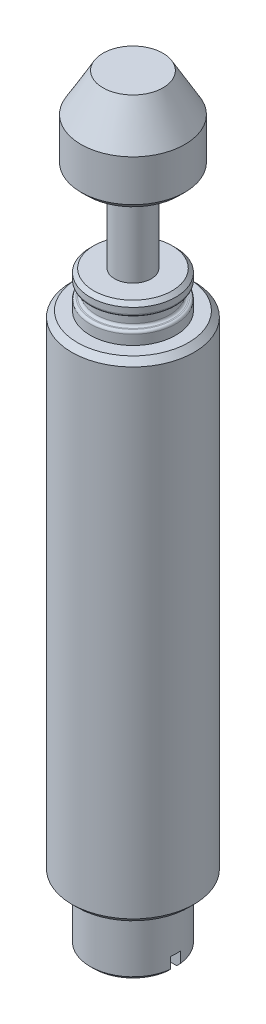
ISO-10303-21;
HEADER;
FILE_DESCRIPTION(('STEP AP214'),'2;1');
FILE_NAME('part.step','',(''),(''),'','','');
FILE_SCHEMA(('AUTOMOTIVE_DESIGN { 1 0 10303 214 1 1 1 1 }'));
ENDSEC;
DATA;
#1=APPLICATION_CONTEXT('core data for automotive mechanical design processes');
#2=APPLICATION_PROTOCOL_DEFINITION('international standard','automotive_design',2000,#1);
#3=PRODUCT_CONTEXT('',#1,'mechanical');
#4=PRODUCT('Part','Part','',(#3));
#5=PRODUCT_RELATED_PRODUCT_CATEGORY('part','',(#4));
#6=PRODUCT_DEFINITION_FORMATION('','',#4);
#7=PRODUCT_DEFINITION_CONTEXT('part definition',#1,'design');
#8=PRODUCT_DEFINITION('design','',#6,#7);
#9=PRODUCT_DEFINITION_SHAPE('','',#8);
#10=(LENGTH_UNIT() NAMED_UNIT(*) SI_UNIT(.MILLI.,.METRE.));
#11=(NAMED_UNIT(*) PLANE_ANGLE_UNIT() SI_UNIT($,.RADIAN.));
#12=(NAMED_UNIT(*) SI_UNIT($,.STERADIAN.) SOLID_ANGLE_UNIT());
#13=UNCERTAINTY_MEASURE_WITH_UNIT(LENGTH_MEASURE(1.E-05),#10,'distance_accuracy_value','');
#14=(GEOMETRIC_REPRESENTATION_CONTEXT(3) GLOBAL_UNCERTAINTY_ASSIGNED_CONTEXT((#13)) GLOBAL_UNIT_ASSIGNED_CONTEXT((#10,
#11,#12)) REPRESENTATION_CONTEXT('',''));
#15=CARTESIAN_POINT('',(0.,0.,0.));
#16=DIRECTION('',(0.,0.,1.));
#17=DIRECTION('',(1.,0.,0.));
#18=AXIS2_PLACEMENT_3D('',#15,#16,#17);
#19=CARTESIAN_POINT('',(0.,0.,0.));
#20=DIRECTION('',(0.,1.,0.));
#21=DIRECTION('',(0.,0.,1.));
#22=AXIS2_PLACEMENT_3D('',#19,#20,#21);
#23=CYLINDRICAL_SURFACE('',#22,3.5);
#24=CARTESIAN_POINT('',(0.,5.,0.));
#25=DIRECTION('',(0.,1.,0.));
#26=DIRECTION('',(0.,0.,1.));
#27=AXIS2_PLACEMENT_3D('',#24,#25,#26);
#28=CIRCLE('',#27,3.5);
#29=CARTESIAN_POINT('',(0.,5.,3.5));
#30=VERTEX_POINT('',#29);
#31=EDGE_CURVE('E431',#30,#30,#28,.T.);
#32=ORIENTED_EDGE('',*,*,#31,.F.);
#33=EDGE_LOOP('',(#32));
#34=FACE_BOUND('',#33,.T.);
#35=DIRECTION('',(0.,1.,0.));
#36=VECTOR('',#35,1.);
#37=CARTESIAN_POINT('',(3.47706773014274,0.,-0.4));
#38=LINE('',#37,#36);
#39=CARTESIAN_POINT('',(3.47706773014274,0.3,-0.4));
#40=VERTEX_POINT('',#39);
#41=CARTESIAN_POINT('',(3.47706773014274,1.2,-0.4));
#42=VERTEX_POINT('',#41);
#43=EDGE_CURVE('E235',#40,#42,#38,.T.);
#44=ORIENTED_EDGE('',*,*,#43,.F.);
#45=CARTESIAN_POINT('',(0.,0.3,0.));
#46=DIRECTION('',(0.,1.,0.));
#47=DIRECTION('',(0.,0.,1.));
#48=AXIS2_PLACEMENT_3D('',#45,#46,#47);
#49=CIRCLE('',#48,3.5);
#50=CARTESIAN_POINT('',(-3.47706773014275,0.300000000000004,-0.4));
#51=VERTEX_POINT('',#50);
#52=EDGE_CURVE('E430',#40,#51,#49,.T.);
#53=ORIENTED_EDGE('',*,*,#52,.T.);
#54=DIRECTION('',(0.,1.,0.));
#55=VECTOR('',#54,1.);
#56=CARTESIAN_POINT('',(-3.47706773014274,0.,-0.4));
#57=LINE('',#56,#55);
#58=CARTESIAN_POINT('',(-3.47706773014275,1.2,-0.4));
#59=VERTEX_POINT('',#58);
#60=EDGE_CURVE('E527',#59,#51,#57,.F.);
#61=ORIENTED_EDGE('',*,*,#60,.F.);
#62=CARTESIAN_POINT('',(0.,1.2,0.));
#63=DIRECTION('',(0.,1.,0.));
#64=DIRECTION('',(0.,0.,1.));
#65=AXIS2_PLACEMENT_3D('',#62,#63,#64);
#66=CIRCLE('',#65,3.5);
#67=CARTESIAN_POINT('',(-3.47706773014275,1.2,0.4));
#68=VERTEX_POINT('',#67);
#69=EDGE_CURVE('E171',#59,#68,#66,.T.);
#70=ORIENTED_EDGE('',*,*,#69,.T.);
#71=DIRECTION('',(0.,1.,0.));
#72=VECTOR('',#71,1.);
#73=CARTESIAN_POINT('',(-3.47706773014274,0.,0.4));
#74=LINE('',#73,#72);
#75=CARTESIAN_POINT('',(-3.47706773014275,0.300000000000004,0.4));
#76=VERTEX_POINT('',#75);
#77=EDGE_CURVE('E188',#68,#76,#74,.F.);
#78=ORIENTED_EDGE('',*,*,#77,.T.);
#79=CARTESIAN_POINT('',(3.47706773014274,0.3,0.4));
#80=VERTEX_POINT('',#79);
#81=EDGE_CURVE('E183',#76,#80,#49,.T.);
#82=ORIENTED_EDGE('',*,*,#81,.T.);
#83=DIRECTION('',(0.,1.,0.));
#84=VECTOR('',#83,1.);
#85=CARTESIAN_POINT('',(3.47706773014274,0.,0.4));
#86=LINE('',#85,#84);
#87=CARTESIAN_POINT('',(3.47706773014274,1.2,0.4));
#88=VERTEX_POINT('',#87);
#89=EDGE_CURVE('E174',#80,#88,#86,.T.);
#90=ORIENTED_EDGE('',*,*,#89,.T.);
#91=EDGE_CURVE('E160',#88,#42,#66,.T.);
#92=ORIENTED_EDGE('',*,*,#91,.T.);
#93=EDGE_LOOP('',(#44,#53,#61,#70,#78,#82,#90,#92));
#94=FACE_BOUND('',#93,.T.);
#95=ADVANCED_FACE('F16',(#34,#94),#23,.T.);
#96=CARTESIAN_POINT('',(0.,0.,0.));
#97=DIRECTION('',(0.,1.,0.));
#98=DIRECTION('',(0.,0.,1.));
#99=AXIS2_PLACEMENT_3D('',#96,#97,#98);
#100=CONICAL_SURFACE('',#99,3.2,0.785398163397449);
#101=CARTESIAN_POINT('',(-7.69366422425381,4.50405537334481,-0.4));
#102=CARTESIAN_POINT('',(-7.43089533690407,4.24164373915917,-0.4));
#103=CARTESIAN_POINT('',(-7.16811098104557,3.97924758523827,-0.4));
#104=CARTESIAN_POINT('',(-6.64248945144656,3.45450405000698,-0.4));
#105=CARTESIAN_POINT('',(-6.37965227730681,3.19215666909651,-0.4));
#106=CARTESIAN_POINT('',(-5.85386035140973,2.66748570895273,-0.4));
#107=CARTESIAN_POINT('',(-5.5909055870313,2.40516214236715,-0.4));
#108=CARTESIAN_POINT('',(-5.06489176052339,1.88062360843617,-0.4));
#109=CARTESIAN_POINT('',(-4.80183269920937,1.61840864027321,-0.4));
#110=CARTESIAN_POINT('',(-4.26890647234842,1.08754045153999,-0.4));
#111=CARTESIAN_POINT('',(-3.99903492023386,0.8188916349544,-0.4));
#112=CARTESIAN_POINT('',(-3.45897379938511,0.281901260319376,-0.4));
#113=CARTESIAN_POINT('',(-3.18878422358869,0.01355970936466,-0.4));
#114=CARTESIAN_POINT('',(-2.78302082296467,-0.388438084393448,-0.4));
#115=CARTESIAN_POINT('',(-2.64769430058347,-0.522343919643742,-0.4));
#116=CARTESIAN_POINT('',(-2.37677910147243,-0.789893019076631,-0.4));
#117=CARTESIAN_POINT('',(-2.24119042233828,-0.923536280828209,-0.4));
#118=CARTESIAN_POINT('',(-1.96958056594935,-1.19037082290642,-0.4));
#119=CARTESIAN_POINT('',(-1.83355940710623,-1.32356212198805,-0.4));
#120=CARTESIAN_POINT('',(-1.56073548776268,-1.58914124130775,-0.4));
#121=CARTESIAN_POINT('',(-1.4239327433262,-1.72152907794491,-0.4));
#122=CARTESIAN_POINT('',(-1.24903858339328,-1.88851837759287,-0.4));
#123=CARTESIAN_POINT('',(-1.21176639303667,-1.92397680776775,-0.4));
#124=CARTESIAN_POINT('',(-1.13704609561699,-1.99470900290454,-0.4));
#125=CARTESIAN_POINT('',(-1.09959798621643,-2.02998276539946,-0.4));
#126=CARTESIAN_POINT('',(-1.02456797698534,-2.1001976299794,-0.4));
#127=CARTESIAN_POINT('',(-0.986986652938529,-2.13513934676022,-0.4));
#128=CARTESIAN_POINT('',(-0.91151636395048,-2.20468743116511,-0.4));
#129=CARTESIAN_POINT('',(-0.873627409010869,-2.23929380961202,-0.4));
#130=CARTESIAN_POINT('',(-0.784515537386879,-2.31967237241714,-0.4));
#131=CARTESIAN_POINT('',(-0.733122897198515,-2.36525649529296,-0.4));
#132=CARTESIAN_POINT('',(-0.628842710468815,-2.45520239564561,-0.4));
#133=CARTESIAN_POINT('',(-0.575949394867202,-2.49955761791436,-0.4));
#134=CARTESIAN_POINT('',(-0.494596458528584,-2.56410877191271,-0.4));
#135=CARTESIAN_POINT('',(-0.467005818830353,-2.58539295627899,-0.4));
#136=CARTESIAN_POINT('',(-0.410979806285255,-2.62681128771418,-0.4));
#137=CARTESIAN_POINT('',(-0.382544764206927,-2.64694587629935,-0.4));
#138=CARTESIAN_POINT('',(-0.324620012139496,-2.68530788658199,-0.4));
#139=CARTESIAN_POINT('',(-0.29513683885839,-2.70354503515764,-0.4));
#140=CARTESIAN_POINT('',(-0.234534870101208,-2.73700088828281,-0.4));
#141=CARTESIAN_POINT('',(-0.203420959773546,-2.75222802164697,-0.4));
#142=CARTESIAN_POINT('',(-0.147017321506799,-2.77441580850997,-0.4));
#143=CARTESIAN_POINT('',(-0.122182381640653,-2.78248890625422,-0.4));
#144=CARTESIAN_POINT('',(-0.0715758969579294,-2.79438157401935,-0.4));
#145=CARTESIAN_POINT('',(-0.0458094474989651,-2.79822147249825,-0.4));
#146=CARTESIAN_POINT('',(0.00620454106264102,-2.80079877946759,-0.4));
#147=CARTESIAN_POINT('',(0.0324542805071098,-2.7994950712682,-0.4));
#148=CARTESIAN_POINT('',(0.0842976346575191,-2.79203046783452,-0.4));
#149=CARTESIAN_POINT('',(0.109888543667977,-2.78585208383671,-0.4));
#150=CARTESIAN_POINT('',(0.158689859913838,-2.77026790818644,-0.4));
#151=CARTESIAN_POINT('',(0.181955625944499,-2.76102617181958,-0.4));
#152=CARTESIAN_POINT('',(0.227476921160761,-2.74028867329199,-0.4));
#153=CARTESIAN_POINT('',(0.249730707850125,-2.72878919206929,-0.4));
#154=CARTESIAN_POINT('',(0.293539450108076,-2.70418317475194,-0.4));
#155=CARTESIAN_POINT('',(0.315087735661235,-2.69106498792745,-0.4));
#156=CARTESIAN_POINT('',(0.357478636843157,-2.6637816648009,-0.4));
#157=CARTESIAN_POINT('',(0.378321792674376,-2.64961735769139,-0.4));
#158=CARTESIAN_POINT('',(0.443390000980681,-2.60368777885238,-0.4));
#159=CARTESIAN_POINT('',(0.486662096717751,-2.57058285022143,-0.4));
#160=CARTESIAN_POINT('',(0.571818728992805,-2.50262339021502,-0.4));
#161=CARTESIAN_POINT('',(0.613702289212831,-2.46776766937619,-0.4));
#162=CARTESIAN_POINT('',(0.696666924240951,-2.39695793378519,-0.4));
#163=CARTESIAN_POINT('',(0.737746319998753,-2.36100195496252,-0.4));
#164=CARTESIAN_POINT('',(0.819308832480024,-2.2884493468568,-0.4));
#165=CARTESIAN_POINT('',(0.859792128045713,-2.25185291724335,-0.4));
#166=CARTESIAN_POINT('',(0.980455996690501,-2.14160002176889,-0.4));
#167=CARTESIAN_POINT('',(1.06005127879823,-2.0673042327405,-0.4));
#168=CARTESIAN_POINT('',(1.21833637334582,-1.91793900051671,-0.4));
#169=CARTESIAN_POINT('',(1.29702710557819,-1.84287052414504,-0.4));
#170=CARTESIAN_POINT('',(1.45350064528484,-1.69262203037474,-0.4));
#171=CARTESIAN_POINT('',(1.53128605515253,-1.61744472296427,-0.4));
#172=CARTESIAN_POINT('',(1.68654537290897,-1.46676892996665,-0.4));
#173=CARTESIAN_POINT('',(1.76401927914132,-1.39127044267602,-0.4));
#174=CARTESIAN_POINT('',(1.99613316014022,-1.16445343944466,-0.4));
#175=CARTESIAN_POINT('',(2.15046194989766,-1.01281661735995,-0.4));
#176=CARTESIAN_POINT('',(2.45876724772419,-0.709043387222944,-0.4));
#177=CARTESIAN_POINT('',(2.61274355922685,-0.556906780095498,-0.4));
#178=CARTESIAN_POINT('',(2.92043898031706,-0.252376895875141,-0.4));
#179=CARTESIAN_POINT('',(3.07415809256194,-0.0999836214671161,-0.4));
#180=CARTESIAN_POINT('',(3.53496294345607,0.357318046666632,-0.4));
#181=CARTESIAN_POINT('',(3.84181304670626,0.662463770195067,-0.4));
#182=CARTESIAN_POINT('',(4.45518005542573,1.27300829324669,-0.4));
#183=CARTESIAN_POINT('',(4.76169699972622,1.57840705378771,-0.4));
#184=CARTESIAN_POINT('',(5.28701682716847,2.10209890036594,-0.4));
#185=CARTESIAN_POINT('',(5.50586091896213,2.32035064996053,-0.4));
#186=CARTESIAN_POINT('',(5.94349757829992,2.7569229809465,-0.4));
#187=CARTESIAN_POINT('',(6.16229014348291,2.97524356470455,-0.4));
#188=CARTESIAN_POINT('',(6.59986905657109,3.41196517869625,-0.4));
#189=CARTESIAN_POINT('',(6.81865539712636,3.63036621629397,-0.4));
#190=CARTESIAN_POINT('',(7.25618636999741,4.06719281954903,-0.4));
#191=CARTESIAN_POINT('',(7.47493100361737,4.28561838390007,-0.4));
#192=CARTESIAN_POINT('',(7.69366422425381,4.50405537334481,-0.4));
#193=B_SPLINE_CURVE_WITH_KNOTS('',3,(#101,#102,#103,#104,#105,#106,#107,#108,#109,#110,#111,
#112,#113,#114,#115,#116,#117,#118,#119,#120,#121,#122,#123,#124,#125,#126,#127,#128,#129,#130,
#131,#132,#133,#134,#135,#136,#137,#138,#139,#140,#141,#142,#143,#144,#145,#146,#147,#148,#149,
#150,#151,#152,#153,#154,#155,#156,#157,#158,#159,#160,#161,#162,#163,#164,#165,#166,#167,#168,
#169,#170,#171,#172,#173,#174,#175,#176,#177,#178,#179,#180,#181,#182,#183,#184,#185,#186,#187,
#188,#189,#190,#191,#192),.UNSPECIFIED.,.F.,.F.,(4,2,2,2,2,2,2,2,2,2,2,2,2,2,2,2,2,2,2,2,2,2,2,
2,2,2,2,2,2,2,2,2,2,2,2,2,2,2,2,2,2,2,2,2,2,4),(0.,1.11407639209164,2.22816154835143,
3.34244594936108,4.45672180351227,5.59909892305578,6.74150190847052,7.31263781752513,
7.88377898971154,8.4548961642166,9.0260016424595,9.18033407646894,9.33466856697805,
9.48861374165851,9.64255393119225,9.84863311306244,10.0556562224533,10.1601771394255,
10.2646576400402,10.3685729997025,10.4721931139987,10.5502719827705,10.6279742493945,
10.7062989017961,10.784905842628,10.8598447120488,10.9349080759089,11.0105472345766,
11.0861270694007,11.2494684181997,11.4129222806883,11.5766872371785,11.7404020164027,
12.0670314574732,12.393292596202,12.7178209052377,13.0423509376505,13.6914249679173,
14.340800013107,14.9901683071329,16.2884120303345,17.5864833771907,18.5137045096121,
19.4409620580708,20.3683768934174,21.2957551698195),.UNSPECIFIED.);
#194=CARTESIAN_POINT('',(-3.17490157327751,0.,-0.4));
#195=VERTEX_POINT('',#194);
#196=EDGE_CURVE('E236',#51,#195,#193,.T.);
#197=ORIENTED_EDGE('',*,*,#196,.F.);
#198=ORIENTED_EDGE('',*,*,#52,.F.);
#199=CARTESIAN_POINT('',(3.17490157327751,0.,-0.4));
#200=VERTEX_POINT('',#199);
#201=EDGE_CURVE('E229',#200,#40,#193,.T.);
#202=ORIENTED_EDGE('',*,*,#201,.F.);
#203=CARTESIAN_POINT('',(0.,0.,0.));
#204=DIRECTION('',(0.,1.,0.));
#205=DIRECTION('',(0.,0.,1.));
#206=AXIS2_PLACEMENT_3D('',#203,#204,#205);
#207=CIRCLE('',#206,3.2);
#208=EDGE_CURVE('E428',#200,#195,#207,.T.);
#209=ORIENTED_EDGE('',*,*,#208,.T.);
#210=EDGE_LOOP('',(#197,#198,#202,#209));
#211=FACE_BOUND('',#210,.T.);
#212=ADVANCED_FACE('F246',(#211),#100,.T.);
#213=CARTESIAN_POINT('',(3.2,0.,0.));
#214=DIRECTION('',(0.,1.,0.));
#215=DIRECTION('',(0.,0.,1.));
#216=AXIS2_PLACEMENT_3D('',#213,#214,#215);
#217=PLANE('',#216);
#218=DIRECTION('',(1.,0.,0.));
#219=VECTOR('',#218,1.);
#220=CARTESIAN_POINT('',(-5.,0.,-0.4));
#221=LINE('',#220,#219);
#222=CARTESIAN_POINT('',(-1.44568322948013,0.,-0.4));
#223=VERTEX_POINT('',#222);
#224=EDGE_CURVE('E542',#195,#223,#221,.T.);
#225=ORIENTED_EDGE('',*,*,#224,.F.);
#226=ORIENTED_EDGE('',*,*,#208,.F.);
#227=CARTESIAN_POINT('',(1.4456832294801,0.,-0.4));
#228=VERTEX_POINT('',#227);
#229=EDGE_CURVE('E538',#228,#200,#221,.T.);
#230=ORIENTED_EDGE('',*,*,#229,.F.);
#231=CARTESIAN_POINT('',(0.,0.,0.));
#232=DIRECTION('',(0.,1.,0.));
#233=DIRECTION('',(-1.,0.,0.));
#234=AXIS2_PLACEMENT_3D('',#231,#232,#233);
#235=CIRCLE('',#234,1.5);
#236=EDGE_CURVE('E415',#228,#223,#235,.T.);
#237=ORIENTED_EDGE('',*,*,#236,.T.);
#238=EDGE_LOOP('',(#225,#226,#230,#237));
#239=FACE_BOUND('',#238,.T.);
#240=ADVANCED_FACE('F400',(#239),#217,.F.);
#241=CARTESIAN_POINT('',(0.,0.9295,0.));
#242=DIRECTION('',(0.,1.,0.));
#243=DIRECTION('',(-1.,0.,0.));
#244=AXIS2_PLACEMENT_3D('',#241,#242,#243);
#245=CONICAL_SURFACE('',#244,1.2295,0.785398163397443);
#246=CARTESIAN_POINT('',(0.,1.2,0.));
#247=DIRECTION('',(0.,1.,0.));
#248=DIRECTION('',(-1.,0.,0.));
#249=AXIS2_PLACEMENT_3D('',#246,#247,#248);
#250=CIRCLE('',#249,1.5);
#251=CARTESIAN_POINT('',(1.4456832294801,1.2,-0.4));
#252=VERTEX_POINT('',#251);
#253=CARTESIAN_POINT('',(-1.44568322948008,1.2,-0.4));
#254=VERTEX_POINT('',#253);
#255=EDGE_CURVE('E422',#252,#254,#250,.T.);
#256=ORIENTED_EDGE('',*,*,#255,.T.);
#257=CARTESIAN_POINT('',(-3.28322568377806,3.00750221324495,-0.4));
#258=CARTESIAN_POINT('',(-3.18446874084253,2.90947345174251,-0.4));
#259=CARTESIAN_POINT('',(-3.08568262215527,2.81147404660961,-0.4));
#260=CARTESIAN_POINT('',(-2.88799993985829,2.61553875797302,-0.4));
#261=CARTESIAN_POINT('',(-2.78910335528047,2.51760289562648,-0.4));
#262=CARTESIAN_POINT('',(-2.59071182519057,2.32136864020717,-0.4));
#263=CARTESIAN_POINT('',(-2.49121631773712,2.22307081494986,-0.4));
#264=CARTESIAN_POINT('',(-2.29208328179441,2.0266668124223,-0.4));
#265=CARTESIAN_POINT('',(-2.19244579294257,1.92856059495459,-0.4));
#266=CARTESIAN_POINT('',(-1.96151163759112,1.70172531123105,-0.4));
#267=CARTESIAN_POINT('',(-1.8301284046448,1.57308418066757,-0.4));
#268=CARTESIAN_POINT('',(-1.63242887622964,1.38065507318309,-0.4));
#269=CARTESIAN_POINT('',(-1.56639758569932,1.31657451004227,-0.4));
#270=CARTESIAN_POINT('',(-1.4340635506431,1.18870599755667,-0.4));
#271=CARTESIAN_POINT('',(-1.36776083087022,1.12491802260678,-0.4));
#272=CARTESIAN_POINT('',(-1.23499831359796,0.998013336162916,-0.4));
#273=CARTESIAN_POINT('',(-1.16854008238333,0.934894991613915,-0.4));
#274=CARTESIAN_POINT('',(-1.03495225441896,0.809327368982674,-0.4));
#275=CARTESIAN_POINT('',(-0.967822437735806,0.746878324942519,-0.4));
#276=CARTESIAN_POINT('',(-0.832572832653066,0.623254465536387,-0.4));
#277=CARTESIAN_POINT('',(-0.764454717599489,0.562077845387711,-0.4));
#278=CARTESIAN_POINT('',(-0.660700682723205,0.472164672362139,-0.4));
#279=CARTESIAN_POINT('',(-0.625862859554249,0.44251003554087,-0.4));
#280=CARTESIAN_POINT('',(-0.555398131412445,0.384156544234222,-0.4));
#281=CARTESIAN_POINT('',(-0.519771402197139,0.35545748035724,-0.4));
#282=CARTESIAN_POINT('',(-0.471576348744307,0.318326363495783,-0.4));
#283=CARTESIAN_POINT('',(-0.459547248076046,0.309195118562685,-0.4));
#284=CARTESIAN_POINT('',(-0.435332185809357,0.291142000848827,-0.4));
#285=CARTESIAN_POINT('',(-0.423146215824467,0.282220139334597,-0.4));
#286=CARTESIAN_POINT('',(-0.386298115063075,0.255815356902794,-0.4));
#287=CARTESIAN_POINT('',(-0.361363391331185,0.238706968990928,-0.4));
#288=CARTESIAN_POINT('',(-0.310793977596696,0.206183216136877,-0.4));
#289=CARTESIAN_POINT('',(-0.285170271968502,0.190751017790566,-0.4));
#290=CARTESIAN_POINT('',(-0.232668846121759,0.162221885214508,-0.4));
#291=CARTESIAN_POINT('',(-0.205793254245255,0.149121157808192,-0.4));
#292=CARTESIAN_POINT('',(-0.152820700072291,0.127576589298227,-0.4));
#293=CARTESIAN_POINT('',(-0.126851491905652,0.118831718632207,-0.4));
#294=CARTESIAN_POINT('',(-0.0738978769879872,0.105971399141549,-0.4));
#295=CARTESIAN_POINT('',(-0.0469214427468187,0.101825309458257,-0.4));
#296=CARTESIAN_POINT('',(0.00757988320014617,0.0991414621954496,-0.4));
#297=CARTESIAN_POINT('',(0.0351075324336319,0.100655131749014,-0.4));
#298=CARTESIAN_POINT('',(0.0894343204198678,0.108980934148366,-0.4));
#299=CARTESIAN_POINT('',(0.116228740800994,0.115821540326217,-0.4));
#300=CARTESIAN_POINT('',(0.167329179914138,0.132944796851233,-0.4));
#301=CARTESIAN_POINT('',(0.191692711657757,0.143065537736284,-0.4));
#302=CARTESIAN_POINT('',(0.239324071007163,0.165656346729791,-0.4));
#303=CARTESIAN_POINT('',(0.262589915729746,0.178130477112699,-0.4));
#304=CARTESIAN_POINT('',(0.308372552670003,0.204721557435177,-0.4));
#305=CARTESIAN_POINT('',(0.330882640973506,0.218849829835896,-0.4));
#306=CARTESIAN_POINT('',(0.375170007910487,0.248160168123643,-0.4));
#307=CARTESIAN_POINT('',(0.396947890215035,0.263341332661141,-0.4));
#308=CARTESIAN_POINT('',(0.465423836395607,0.312821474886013,-0.4));
#309=CARTESIAN_POINT('',(0.511124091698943,0.348490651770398,-0.4));
#310=CARTESIAN_POINT('',(0.60111579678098,0.421574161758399,-0.4));
#311=CARTESIAN_POINT('',(0.645406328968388,0.458989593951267,-0.4));
#312=CARTESIAN_POINT('',(0.733182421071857,0.534907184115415,-0.4));
#313=CARTESIAN_POINT('',(0.776666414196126,0.573411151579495,-0.4));
#314=CARTESIAN_POINT('',(0.863043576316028,0.651047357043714,-0.4));
#315=CARTESIAN_POINT('',(0.905936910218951,0.690179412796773,-0.4));
#316=CARTESIAN_POINT('',(1.03377834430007,0.807963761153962,-0.4));
#317=CARTESIAN_POINT('',(1.11815214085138,0.887238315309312,-0.4));
#318=CARTESIAN_POINT('',(1.28602008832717,1.04654226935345,-0.4));
#319=CARTESIAN_POINT('',(1.36951502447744,1.12657084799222,-0.4));
#320=CARTESIAN_POINT('',(1.6068798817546,1.35539824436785,-0.4));
#321=CARTESIAN_POINT('',(1.76018822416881,1.5047792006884,-0.4));
#322=CARTESIAN_POINT('',(2.06616858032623,1.80431358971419,-0.4));
#323=CARTESIAN_POINT('',(2.21884030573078,1.95446731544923,-0.4));
#324=CARTESIAN_POINT('',(2.52362768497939,2.25500278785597,-0.4));
#325=CARTESIAN_POINT('',(2.67574376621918,2.40538410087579,-0.4));
#326=CARTESIAN_POINT('',(2.97966526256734,2.70632765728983,-0.4));
#327=CARTESIAN_POINT('',(3.13147078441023,2.85688979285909,-0.4));
#328=CARTESIAN_POINT('',(3.28322568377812,3.00750221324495,-0.4));
#329=B_SPLINE_CURVE_WITH_KNOTS('',3,(#257,#258,#259,#260,#261,#262,#263,#264,#265,#266,#267,
#268,#269,#270,#271,#272,#273,#274,#275,#276,#277,#278,#279,#280,#281,#282,#283,#284,#285,#286,
#287,#288,#289,#290,#291,#292,#293,#294,#295,#296,#297,#298,#299,#300,#301,#302,#303,#304,#305,
#306,#307,#308,#309,#310,#311,#312,#313,#314,#315,#316,#317,#318,#319,#320,#321,#322,#323,#324,
#325,#326,#327,#328),.UNSPECIFIED.,.F.,.F.,(4,2,2,2,2,2,2,2,2,2,2,2,2,2,2,2,2,2,2,2,2,2,2,2,2,2,
2,2,2,2,2,2,2,2,2,4),(0.,0.417448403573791,0.834998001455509,1.25458853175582,1.674078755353,
2.2257022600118,2.50174156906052,2.77775624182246,3.05271706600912,3.32777109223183,
3.60240393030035,3.73964589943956,3.87685759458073,3.92216238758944,3.96746961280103,
4.05815098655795,4.14781550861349,4.23733279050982,4.31924673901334,4.40061156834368,
4.48271750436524,4.56526534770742,4.64423797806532,4.72334819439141,4.80303562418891,
4.88265565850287,5.05646761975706,5.23039049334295,5.40462179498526,5.57880342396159,
5.92610782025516,6.27306981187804,6.91521699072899,7.55762885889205,8.19933275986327,
8.84075615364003),.UNSPECIFIED.);
#330=CARTESIAN_POINT('',(-1.16261354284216,0.9295,-0.4));
#331=VERTEX_POINT('',#330);
#332=EDGE_CURVE('E202',#254,#331,#329,.T.);
#333=ORIENTED_EDGE('',*,*,#332,.T.);
#334=CARTESIAN_POINT('',(0.,0.9295,0.));
#335=DIRECTION('',(0.,1.,0.));
#336=DIRECTION('',(-1.,0.,0.));
#337=AXIS2_PLACEMENT_3D('',#334,#335,#336);
#338=CIRCLE('',#337,1.2295);
#339=CARTESIAN_POINT('',(1.16261354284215,0.9295,-0.4));
#340=VERTEX_POINT('',#339);
#341=EDGE_CURVE('E413',#340,#331,#338,.T.);
#342=ORIENTED_EDGE('',*,*,#341,.F.);
#343=EDGE_CURVE('E211',#340,#252,#329,.T.);
#344=ORIENTED_EDGE('',*,*,#343,.T.);
#345=EDGE_LOOP('',(#256,#333,#342,#344));
#346=FACE_BOUND('',#345,.T.);
#347=ADVANCED_FACE('F390',(#346),#245,.F.);
#348=CARTESIAN_POINT('',(0.,0.,0.));
#349=DIRECTION('',(0.,1.,0.));
#350=DIRECTION('',(-1.,0.,0.));
#351=AXIS2_PLACEMENT_3D('',#348,#349,#350);
#352=CYLINDRICAL_SURFACE('',#351,1.2295);
#353=CARTESIAN_POINT('',(0.,0.270500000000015,0.));
#354=DIRECTION('',(0.,1.,0.));
#355=DIRECTION('',(-1.,0.,0.));
#356=AXIS2_PLACEMENT_3D('',#353,#354,#355);
#357=CIRCLE('',#356,1.2295);
#358=CARTESIAN_POINT('',(1.16261354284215,0.270500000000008,-0.4));
#359=VERTEX_POINT('',#358);
#360=CARTESIAN_POINT('',(-1.16261354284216,0.270500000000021,-0.4));
#361=VERTEX_POINT('',#360);
#362=EDGE_CURVE('E405',#359,#361,#357,.T.);
#363=ORIENTED_EDGE('',*,*,#362,.F.);
#364=DIRECTION('',(0.,1.,0.));
#365=VECTOR('',#364,1.);
#366=CARTESIAN_POINT('',(1.16261354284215,0.,-0.4));
#367=LINE('',#366,#365);
#368=EDGE_CURVE('E210',#359,#340,#367,.T.);
#369=ORIENTED_EDGE('',*,*,#368,.T.);
#370=ORIENTED_EDGE('',*,*,#341,.T.);
#371=DIRECTION('',(0.,1.,0.));
#372=VECTOR('',#371,1.);
#373=CARTESIAN_POINT('',(-1.16261354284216,0.,-0.4));
#374=LINE('',#373,#372);
#375=EDGE_CURVE('E199',#331,#361,#374,.F.);
#376=ORIENTED_EDGE('',*,*,#375,.T.);
#377=EDGE_LOOP('',(#363,#369,#370,#376));
#378=FACE_BOUND('',#377,.T.);
#379=ADVANCED_FACE('F384',(#378),#352,.F.);
#380=CARTESIAN_POINT('',(0.,0.,0.));
#381=DIRECTION('',(0.,-1.,0.));
#382=DIRECTION('',(1.,0.,0.));
#383=AXIS2_PLACEMENT_3D('',#380,#381,#382);
#384=CONICAL_SURFACE('',#383,1.5,0.785398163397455);
#385=ORIENTED_EDGE('',*,*,#236,.F.);
#386=CARTESIAN_POINT('',(3.2832256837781,-1.80750221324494,-0.4));
#387=CARTESIAN_POINT('',(3.18446874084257,-1.7094734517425,-0.4));
#388=CARTESIAN_POINT('',(3.0856826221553,-1.6114740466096,-0.4));
#389=CARTESIAN_POINT('',(2.88799993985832,-1.41553875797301,-0.4));
#390=CARTESIAN_POINT('',(2.78910335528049,-1.31760289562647,-0.4));
#391=CARTESIAN_POINT('',(2.59071182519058,-1.12136864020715,-0.4));
#392=CARTESIAN_POINT('',(2.49121631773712,-1.02307081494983,-0.4));
#393=CARTESIAN_POINT('',(2.29208328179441,-0.826666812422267,-0.4));
#394=CARTESIAN_POINT('',(2.19244579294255,-0.728560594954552,-0.4));
#395=CARTESIAN_POINT('',(1.9615116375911,-0.501725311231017,-0.4));
#396=CARTESIAN_POINT('',(1.83012840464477,-0.373084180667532,-0.4));
#397=CARTESIAN_POINT('',(1.63242887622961,-0.180655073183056,-0.4));
#398=CARTESIAN_POINT('',(1.56639758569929,-0.116574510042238,-0.4));
#399=CARTESIAN_POINT('',(1.43406355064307,0.0112940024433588,-0.4));
#400=CARTESIAN_POINT('',(1.36776083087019,0.0750819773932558,-0.4));
#401=CARTESIAN_POINT('',(1.23499831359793,0.201986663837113,-0.4));
#402=CARTESIAN_POINT('',(1.1685400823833,0.265105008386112,-0.4));
#403=CARTESIAN_POINT('',(1.03495225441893,0.390672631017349,-0.4));
#404=CARTESIAN_POINT('',(0.967822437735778,0.453121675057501,-0.4));
#405=CARTESIAN_POINT('',(0.83257283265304,0.576745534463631,-0.4));
#406=CARTESIAN_POINT('',(0.764454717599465,0.637922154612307,-0.4));
#407=CARTESIAN_POINT('',(0.660700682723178,0.72783532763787,-0.4));
#408=CARTESIAN_POINT('',(0.625862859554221,0.757489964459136,-0.4));
#409=CARTESIAN_POINT('',(0.555398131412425,0.815843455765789,-0.4));
#410=CARTESIAN_POINT('',(0.519771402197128,0.84454251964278,-0.4));
#411=CARTESIAN_POINT('',(0.471576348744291,0.881673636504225,-0.4));
#412=CARTESIAN_POINT('',(0.459547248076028,0.890804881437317,-0.4));
#413=CARTESIAN_POINT('',(0.435332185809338,0.90885799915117,-0.4));
#414=CARTESIAN_POINT('',(0.42314621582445,0.9177798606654,-0.4));
#415=CARTESIAN_POINT('',(0.386298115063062,0.944184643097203,-0.4));
#416=CARTESIAN_POINT('',(0.361363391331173,0.961293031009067,-0.4));
#417=CARTESIAN_POINT('',(0.310793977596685,0.993816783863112,-0.4));
#418=CARTESIAN_POINT('',(0.285170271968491,1.00924898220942,-0.4));
#419=CARTESIAN_POINT('',(0.232668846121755,1.03777811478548,-0.4));
#420=CARTESIAN_POINT('',(0.205793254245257,1.05087884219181,-0.4));
#421=CARTESIAN_POINT('',(0.152820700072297,1.07242341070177,-0.4));
#422=CARTESIAN_POINT('',(0.126851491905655,1.08116828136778,-0.4));
#423=CARTESIAN_POINT('',(0.0738978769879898,1.09402860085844,-0.4));
#424=CARTESIAN_POINT('',(0.0469214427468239,1.09817469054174,-0.4));
#425=CARTESIAN_POINT('',(-0.00757988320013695,1.10085853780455,-0.4));
#426=CARTESIAN_POINT('',(-0.0351075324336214,1.09934486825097,-0.4));
#427=CARTESIAN_POINT('',(-0.0894343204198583,1.09101906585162,-0.4));
#428=CARTESIAN_POINT('',(-0.116228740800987,1.08417845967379,-0.4));
#429=CARTESIAN_POINT('',(-0.167329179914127,1.06705520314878,-0.4));
#430=CARTESIAN_POINT('',(-0.191692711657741,1.05693446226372,-0.4));
#431=CARTESIAN_POINT('',(-0.23932407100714,1.03434365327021,-0.4));
#432=CARTESIAN_POINT('',(-0.262589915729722,1.02186952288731,-0.4));
#433=CARTESIAN_POINT('',(-0.308372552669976,0.995278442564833,-0.4));
#434=CARTESIAN_POINT('',(-0.330882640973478,0.981150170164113,-0.4));
#435=CARTESIAN_POINT('',(-0.375170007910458,0.951839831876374,-0.4));
#436=CARTESIAN_POINT('',(-0.396947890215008,0.936658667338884,-0.4));
#437=CARTESIAN_POINT('',(-0.465423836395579,0.887178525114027,-0.4));
#438=CARTESIAN_POINT('',(-0.511124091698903,0.851509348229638,-0.4));
#439=CARTESIAN_POINT('',(-0.601115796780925,0.778425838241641,-0.4));
#440=CARTESIAN_POINT('',(-0.645406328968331,0.74101040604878,-0.4));
#441=CARTESIAN_POINT('',(-0.733182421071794,0.665092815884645,-0.4));
#442=CARTESIAN_POINT('',(-0.776666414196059,0.626588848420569,-0.4));
#443=CARTESIAN_POINT('',(-0.863043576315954,0.548952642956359,-0.4));
#444=CARTESIAN_POINT('',(-0.905936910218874,0.509820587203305,-0.4));
#445=CARTESIAN_POINT('',(-1.03377834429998,0.392036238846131,-0.4));
#446=CARTESIAN_POINT('',(-1.11815214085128,0.312761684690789,-0.4));
#447=CARTESIAN_POINT('',(-1.28602008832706,0.153457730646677,-0.4));
#448=CARTESIAN_POINT('',(-1.36951502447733,0.0734291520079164,-0.4));
#449=CARTESIAN_POINT('',(-1.6068798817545,-0.155398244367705,-0.4));
#450=CARTESIAN_POINT('',(-1.76018822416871,-0.304779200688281,-0.4));
#451=CARTESIAN_POINT('',(-2.06616858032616,-0.604313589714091,-0.4));
#452=CARTESIAN_POINT('',(-2.21884030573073,-0.754467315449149,-0.4));
#453=CARTESIAN_POINT('',(-2.52362768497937,-1.05500278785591,-0.4));
#454=CARTESIAN_POINT('',(-2.67574376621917,-1.20538410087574,-0.4));
#455=CARTESIAN_POINT('',(-2.97966526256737,-1.5063276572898,-0.4));
#456=CARTESIAN_POINT('',(-3.13147078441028,-1.65688979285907,-0.4));
#457=CARTESIAN_POINT('',(-3.28322568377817,-1.80750221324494,-0.4));
#458=B_SPLINE_CURVE_WITH_KNOTS('',3,(#386,#387,#388,#389,#390,#391,#392,#393,#394,#395,#396,
#397,#398,#399,#400,#401,#402,#403,#404,#405,#406,#407,#408,#409,#410,#411,#412,#413,#414,#415,
#416,#417,#418,#419,#420,#421,#422,#423,#424,#425,#426,#427,#428,#429,#430,#431,#432,#433,#434,
#435,#436,#437,#438,#439,#440,#441,#442,#443,#444,#445,#446,#447,#448,#449,#450,#451,#452,#453,
#454,#455,#456,#457),.UNSPECIFIED.,.F.,.F.,(4,2,2,2,2,2,2,2,2,2,2,2,2,2,2,2,2,2,2,2,2,2,2,2,2,2,
2,2,2,2,2,2,2,2,2,4),(0.,0.417448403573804,0.834998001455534,1.25458853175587,1.67407875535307,
2.22570226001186,2.50174156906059,2.77775624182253,3.05271706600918,3.32777109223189,
3.6024039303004,3.73964589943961,3.87685759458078,3.92216238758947,3.96746961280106,
4.05815098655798,4.14781550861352,4.23733279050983,4.31924673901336,4.40061156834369,
4.48271750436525,4.56526534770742,4.64423797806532,4.7233481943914,4.80303562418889,
4.88265565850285,5.05646761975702,5.23039049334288,5.40462179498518,5.57880342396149,
5.92610782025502,6.27306981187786,6.91521699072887,7.55762885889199,8.19933275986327,
8.84075615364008),.UNSPECIFIED.);
#459=EDGE_CURVE('E11',#228,#359,#458,.T.);
#460=ORIENTED_EDGE('',*,*,#459,.T.);
#461=ORIENTED_EDGE('',*,*,#362,.T.);
#462=EDGE_CURVE('E20',#361,#223,#458,.T.);
#463=ORIENTED_EDGE('',*,*,#462,.T.);
#464=EDGE_LOOP('',(#385,#460,#461,#463));
#465=FACE_BOUND('',#464,.T.);
#466=ADVANCED_FACE('F379',(#465),#384,.F.);
#467=CARTESIAN_POINT('',(0.,1.2,0.));
#468=DIRECTION('',(0.,-1.,0.));
#469=DIRECTION('',(1.,0.,0.));
#470=AXIS2_PLACEMENT_3D('',#467,#468,#469);
#471=PLANE('',#470);
#472=DIRECTION('',(-0.866025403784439,0.,-0.5));
#473=VECTOR('',#472,1.);
#474=CARTESIAN_POINT('',(0.324759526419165,1.2,-0.5625));
#475=LINE('',#474,#473);
#476=CARTESIAN_POINT('',(0.649519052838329,1.2,-0.375));
#477=VERTEX_POINT('',#476);
#478=CARTESIAN_POINT('',(0.,1.2,-0.75));
#479=VERTEX_POINT('',#478);
#480=EDGE_CURVE('E355',#477,#479,#475,.T.);
#481=ORIENTED_EDGE('',*,*,#480,.T.);
#482=DIRECTION('',(-0.866025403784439,0.,0.5));
#483=VECTOR('',#482,1.);
#484=CARTESIAN_POINT('',(-0.324759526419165,1.2,-0.5625));
#485=LINE('',#484,#483);
#486=CARTESIAN_POINT('',(-0.649519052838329,1.2,-0.375));
#487=VERTEX_POINT('',#486);
#488=EDGE_CURVE('E347',#479,#487,#485,.T.);
#489=ORIENTED_EDGE('',*,*,#488,.T.);
#490=DIRECTION('',(0.,0.,1.));
#491=VECTOR('',#490,1.);
#492=CARTESIAN_POINT('',(-0.649519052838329,1.2,0.));
#493=LINE('',#492,#491);
#494=CARTESIAN_POINT('',(-0.649519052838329,1.2,0.375));
#495=VERTEX_POINT('',#494);
#496=EDGE_CURVE('E364',#487,#495,#493,.T.);
#497=ORIENTED_EDGE('',*,*,#496,.T.);
#498=DIRECTION('',(0.866025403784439,0.,0.5));
#499=VECTOR('',#498,1.);
#500=CARTESIAN_POINT('',(-0.324759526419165,1.2,0.5625));
#501=LINE('',#500,#499);
#502=CARTESIAN_POINT('',(0.,1.2,0.75));
#503=VERTEX_POINT('',#502);
#504=EDGE_CURVE('E362',#495,#503,#501,.T.);
#505=ORIENTED_EDGE('',*,*,#504,.T.);
#506=DIRECTION('',(0.866025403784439,0.,-0.5));
#507=VECTOR('',#506,1.);
#508=CARTESIAN_POINT('',(0.324759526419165,1.2,0.5625));
#509=LINE('',#508,#507);
#510=CARTESIAN_POINT('',(0.649519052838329,1.2,0.375));
#511=VERTEX_POINT('',#510);
#512=EDGE_CURVE('E360',#503,#511,#509,.T.);
#513=ORIENTED_EDGE('',*,*,#512,.T.);
#514=DIRECTION('',(0.,0.,-1.));
#515=VECTOR('',#514,1.);
#516=CARTESIAN_POINT('',(0.649519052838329,1.2,0.));
#517=LINE('',#516,#515);
#518=EDGE_CURVE('E357',#511,#477,#517,.T.);
#519=ORIENTED_EDGE('',*,*,#518,.T.);
#520=EDGE_LOOP('',(#481,#489,#497,#505,#513,#519));
#521=FACE_BOUND('',#520,.T.);
#522=ORIENTED_EDGE('',*,*,#255,.F.);
#523=DIRECTION('',(-1.,0.,0.));
#524=VECTOR('',#523,1.);
#525=CARTESIAN_POINT('',(5.,1.2,-0.4));
#526=LINE('',#525,#524);
#527=EDGE_CURVE('E167',#42,#252,#526,.T.);
#528=ORIENTED_EDGE('',*,*,#527,.F.);
#529=ORIENTED_EDGE('',*,*,#91,.F.);
#530=DIRECTION('',(-1.,0.,0.));
#531=VECTOR('',#530,1.);
#532=CARTESIAN_POINT('',(5.,1.2,0.4));
#533=LINE('',#532,#531);
#534=CARTESIAN_POINT('',(1.4456832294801,1.2,0.4));
#535=VERTEX_POINT('',#534);
#536=EDGE_CURVE('E165',#88,#535,#533,.T.);
#537=ORIENTED_EDGE('',*,*,#536,.T.);
#538=CARTESIAN_POINT('',(-1.44568322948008,1.2,0.4));
#539=VERTEX_POINT('',#538);
#540=EDGE_CURVE('E423',#539,#535,#250,.T.);
#541=ORIENTED_EDGE('',*,*,#540,.F.);
#542=EDGE_CURVE('E178',#539,#68,#533,.T.);
#543=ORIENTED_EDGE('',*,*,#542,.T.);
#544=ORIENTED_EDGE('',*,*,#69,.F.);
#545=EDGE_CURVE('E544',#254,#59,#526,.T.);
#546=ORIENTED_EDGE('',*,*,#545,.F.);
#547=EDGE_LOOP('',(#522,#528,#529,#537,#541,#543,#544,#546));
#548=FACE_BOUND('',#547,.T.);
#549=ADVANCED_FACE('F163',(#521,#548),#471,.T.);
#550=CARTESIAN_POINT('',(0.,62.,0.));
#551=DIRECTION('',(0.,-1.,0.));
#552=DIRECTION('',(0.,0.,-1.));
#553=AXIS2_PLACEMENT_3D('',#550,#551,#552);
#554=PLANE('',#553);
#555=CARTESIAN_POINT('',(0.,62.,0.));
#556=DIRECTION('',(0.,1.,0.));
#557=DIRECTION('',(0.,0.,1.));
#558=AXIS2_PLACEMENT_3D('',#555,#556,#557);
#559=CIRCLE('',#558,2.45379918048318);
#560=CARTESIAN_POINT('',(0.,62.,2.45379918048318));
#561=VERTEX_POINT('',#560);
#562=EDGE_CURVE('E341',#561,#561,#559,.T.);
#563=ORIENTED_EDGE('',*,*,#562,.T.);
#564=EDGE_LOOP('',(#563));
#565=FACE_BOUND('',#564,.T.);
#566=ADVANCED_FACE('F18',(#565),#554,.F.);
#567=CARTESIAN_POINT('',(0.,58.88888892,0.));
#568=DIRECTION('',(0.,-1.,0.));
#569=DIRECTION('',(0.,0.,-1.));
#570=AXIS2_PLACEMENT_3D('',#567,#568,#569);
#571=CONICAL_SURFACE('',#570,4.25,0.523598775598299);
#572=ORIENTED_EDGE('',*,*,#562,.F.);
#573=EDGE_LOOP('',(#572));
#574=FACE_BOUND('',#573,.T.);
#575=CARTESIAN_POINT('',(0.,58.88888892,0.));
#576=DIRECTION('',(0.,1.,0.));
#577=DIRECTION('',(0.,0.,1.));
#578=AXIS2_PLACEMENT_3D('',#575,#576,#577);
#579=CIRCLE('',#578,4.25);
#580=CARTESIAN_POINT('',(0.,58.88888892,4.25));
#581=VERTEX_POINT('',#580);
#582=EDGE_CURVE('E344',#581,#581,#579,.T.);
#583=ORIENTED_EDGE('',*,*,#582,.T.);
#584=EDGE_LOOP('',(#583));
#585=FACE_BOUND('',#584,.T.);
#586=ADVANCED_FACE('F328',(#574,#585),#571,.T.);
#587=CARTESIAN_POINT('',(0.,0.,0.));
#588=DIRECTION('',(0.,1.,0.));
#589=DIRECTION('',(0.,0.,1.));
#590=AXIS2_PLACEMENT_3D('',#587,#588,#589);
#591=CYLINDRICAL_SURFACE('',#590,4.25);
#592=ORIENTED_EDGE('',*,*,#582,.F.);
#593=EDGE_LOOP('',(#592));
#594=FACE_BOUND('',#593,.T.);
#595=CARTESIAN_POINT('',(0.,55.5,0.));
#596=DIRECTION('',(0.,1.,0.));
#597=DIRECTION('',(0.,0.,1.));
#598=AXIS2_PLACEMENT_3D('',#595,#596,#597);
#599=CIRCLE('',#598,4.25);
#600=CARTESIAN_POINT('',(0.,55.5,4.25));
#601=VERTEX_POINT('',#600);
#602=EDGE_CURVE('E345',#601,#601,#599,.T.);
#603=ORIENTED_EDGE('',*,*,#602,.T.);
#604=EDGE_LOOP('',(#603));
#605=FACE_BOUND('',#604,.T.);
#606=ADVANCED_FACE('F325',(#594,#605),#591,.T.);
#607=CARTESIAN_POINT('',(0.,55.,0.));
#608=DIRECTION('',(0.,1.,0.));
#609=DIRECTION('',(0.,0.,1.));
#610=AXIS2_PLACEMENT_3D('',#607,#608,#609);
#611=CONICAL_SURFACE('',#610,3.75,0.785398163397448);
#612=ORIENTED_EDGE('',*,*,#602,.F.);
#613=EDGE_LOOP('',(#612));
#614=FACE_BOUND('',#613,.T.);
#615=CARTESIAN_POINT('',(0.,55.,0.));
#616=DIRECTION('',(0.,1.,0.));
#617=DIRECTION('',(0.,0.,1.));
#618=AXIS2_PLACEMENT_3D('',#615,#616,#617);
#619=CIRCLE('',#618,3.75);
#620=CARTESIAN_POINT('',(0.,55.,3.75));
#621=VERTEX_POINT('',#620);
#622=EDGE_CURVE('E350',#621,#621,#619,.T.);
#623=ORIENTED_EDGE('',*,*,#622,.T.);
#624=EDGE_LOOP('',(#623));
#625=FACE_BOUND('',#624,.T.);
#626=ADVANCED_FACE('F321',(#614,#625),#611,.T.);
#627=CARTESIAN_POINT('',(3.75,55.,0.));
#628=DIRECTION('',(0.,1.,0.));
#629=DIRECTION('',(0.,0.,1.));
#630=AXIS2_PLACEMENT_3D('',#627,#628,#629);
#631=PLANE('',#630);
#632=ORIENTED_EDGE('',*,*,#622,.F.);
#633=EDGE_LOOP('',(#632));
#634=FACE_BOUND('',#633,.T.);
#635=CARTESIAN_POINT('',(0.,55.,0.));
#636=DIRECTION('',(0.,1.,0.));
#637=DIRECTION('',(0.,0.,1.));
#638=AXIS2_PLACEMENT_3D('',#635,#636,#637);
#639=CIRCLE('',#638,1.5);
#640=CARTESIAN_POINT('',(0.,55.,1.5));
#641=VERTEX_POINT('',#640);
#642=EDGE_CURVE('E482',#641,#641,#639,.T.);
#643=ORIENTED_EDGE('',*,*,#642,.T.);
#644=EDGE_LOOP('',(#643));
#645=FACE_BOUND('',#644,.T.);
#646=ADVANCED_FACE('F317',(#634,#645),#631,.F.);
#647=CARTESIAN_POINT('',(0.,0.,0.));
#648=DIRECTION('',(0.,1.,0.));
#649=DIRECTION('',(0.,0.,1.));
#650=AXIS2_PLACEMENT_3D('',#647,#648,#649);
#651=CYLINDRICAL_SURFACE('',#650,1.5);
#652=ORIENTED_EDGE('',*,*,#642,.F.);
#653=EDGE_LOOP('',(#652));
#654=FACE_BOUND('',#653,.T.);
#655=CARTESIAN_POINT('',(0.,48.,0.));
#656=DIRECTION('',(0.,1.,0.));
#657=DIRECTION('',(0.,0.,1.));
#658=AXIS2_PLACEMENT_3D('',#655,#656,#657);
#659=CIRCLE('',#658,1.5);
#660=CARTESIAN_POINT('',(0.,48.,1.5));
#661=VERTEX_POINT('',#660);
#662=EDGE_CURVE('E479',#661,#661,#659,.T.);
#663=ORIENTED_EDGE('',*,*,#662,.T.);
#664=EDGE_LOOP('',(#663));
#665=FACE_BOUND('',#664,.T.);
#666=ADVANCED_FACE('F313',(#654,#665),#651,.T.);
#667=CARTESIAN_POINT('',(1.5,48.,0.));
#668=DIRECTION('',(0.,-1.,0.));
#669=DIRECTION('',(0.,0.,-1.));
#670=AXIS2_PLACEMENT_3D('',#667,#668,#669);
#671=PLANE('',#670);
#672=ORIENTED_EDGE('',*,*,#662,.F.);
#673=EDGE_LOOP('',(#672));
#674=FACE_BOUND('',#673,.T.);
#675=CARTESIAN_POINT('',(0.,48.,0.));
#676=DIRECTION('',(0.,1.,0.));
#677=DIRECTION('',(0.,0.,1.));
#678=AXIS2_PLACEMENT_3D('',#675,#676,#677);
#679=CIRCLE('',#678,3.2);
#680=CARTESIAN_POINT('',(0.,48.,3.2));
#681=VERTEX_POINT('',#680);
#682=EDGE_CURVE('E476',#681,#681,#679,.T.);
#683=ORIENTED_EDGE('',*,*,#682,.T.);
#684=EDGE_LOOP('',(#683));
#685=FACE_BOUND('',#684,.T.);
#686=ADVANCED_FACE('F309',(#674,#685),#671,.F.);
#687=CARTESIAN_POINT('',(0.,47.7,0.));
#688=DIRECTION('',(0.,-1.,0.));
#689=DIRECTION('',(0.,0.,-1.));
#690=AXIS2_PLACEMENT_3D('',#687,#688,#689);
#691=CONICAL_SURFACE('',#690,3.5,0.785398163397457);
#692=ORIENTED_EDGE('',*,*,#682,.F.);
#693=EDGE_LOOP('',(#692));
#694=FACE_BOUND('',#693,.T.);
#695=CARTESIAN_POINT('',(0.,47.7,0.));
#696=DIRECTION('',(0.,1.,0.));
#697=DIRECTION('',(0.,0.,1.));
#698=AXIS2_PLACEMENT_3D('',#695,#696,#697);
#699=CIRCLE('',#698,3.5);
#700=CARTESIAN_POINT('',(0.,47.7,3.5));
#701=VERTEX_POINT('',#700);
#702=EDGE_CURVE('E473',#701,#701,#699,.T.);
#703=ORIENTED_EDGE('',*,*,#702,.T.);
#704=EDGE_LOOP('',(#703));
#705=FACE_BOUND('',#704,.T.);
#706=ADVANCED_FACE('F305',(#694,#705),#691,.T.);
#707=CARTESIAN_POINT('',(0.,0.,0.));
#708=DIRECTION('',(0.,1.,0.));
#709=DIRECTION('',(0.,0.,1.));
#710=AXIS2_PLACEMENT_3D('',#707,#708,#709);
#711=CYLINDRICAL_SURFACE('',#710,3.5);
#712=ORIENTED_EDGE('',*,*,#702,.F.);
#713=EDGE_LOOP('',(#712));
#714=FACE_BOUND('',#713,.T.);
#715=CARTESIAN_POINT('',(0.,47.2,0.));
#716=DIRECTION('',(0.,1.,0.));
#717=DIRECTION('',(0.,0.,1.));
#718=AXIS2_PLACEMENT_3D('',#715,#716,#717);
#719=CIRCLE('',#718,3.5);
#720=CARTESIAN_POINT('',(0.,47.2,3.5));
#721=VERTEX_POINT('',#720);
#722=EDGE_CURVE('E470',#721,#721,#719,.T.);
#723=ORIENTED_EDGE('',*,*,#722,.T.);
#724=EDGE_LOOP('',(#723));
#725=FACE_BOUND('',#724,.T.);
#726=ADVANCED_FACE('F301',(#714,#725),#711,.T.);
#727=CARTESIAN_POINT('',(0.,47.2,0.));
#728=DIRECTION('',(0.,1.,0.));
#729=DIRECTION('',(0.,0.,1.));
#730=AXIS2_PLACEMENT_3D('',#727,#728,#729);
#731=TOROIDAL_SURFACE('',#730,3.3,0.2);
#732=ORIENTED_EDGE('',*,*,#722,.F.);
#733=EDGE_LOOP('',(#732));
#734=FACE_BOUND('',#733,.T.);
#735=CARTESIAN_POINT('',(0.,47.,0.));
#736=DIRECTION('',(0.,1.,0.));
#737=DIRECTION('',(0.,0.,1.));
#738=AXIS2_PLACEMENT_3D('',#735,#736,#737);
#739=CIRCLE('',#738,3.3);
#740=CARTESIAN_POINT('',(0.,47.,3.3));
#741=VERTEX_POINT('',#740);
#742=EDGE_CURVE('E467',#741,#741,#739,.T.);
#743=ORIENTED_EDGE('',*,*,#742,.T.);
#744=EDGE_LOOP('',(#743));
#745=FACE_BOUND('',#744,.T.);
#746=ADVANCED_FACE('F297',(#734,#745),#731,.T.);
#747=CARTESIAN_POINT('',(3.3,47.,0.));
#748=DIRECTION('',(0.,1.,0.));
#749=DIRECTION('',(0.,0.,1.));
#750=AXIS2_PLACEMENT_3D('',#747,#748,#749);
#751=PLANE('',#750);
#752=ORIENTED_EDGE('',*,*,#742,.F.);
#753=EDGE_LOOP('',(#752));
#754=FACE_BOUND('',#753,.T.);
#755=CARTESIAN_POINT('',(0.,47.,0.));
#756=DIRECTION('',(0.,1.,0.));
#757=DIRECTION('',(0.,0.,1.));
#758=AXIS2_PLACEMENT_3D('',#755,#756,#757);
#759=CIRCLE('',#758,3.2);
#760=CARTESIAN_POINT('',(0.,47.,3.2));
#761=VERTEX_POINT('',#760);
#762=EDGE_CURVE('E464',#761,#761,#759,.T.);
#763=ORIENTED_EDGE('',*,*,#762,.T.);
#764=EDGE_LOOP('',(#763));
#765=FACE_BOUND('',#764,.T.);
#766=ADVANCED_FACE('F293',(#754,#765),#751,.F.);
#767=CARTESIAN_POINT('',(0.,46.8,0.));
#768=DIRECTION('',(0.,1.,0.));
#769=DIRECTION('',(0.,0.,1.));
#770=AXIS2_PLACEMENT_3D('',#767,#768,#769);
#771=TOROIDAL_SURFACE('',#770,3.2,0.200000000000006);
#772=ORIENTED_EDGE('',*,*,#762,.F.);
#773=EDGE_LOOP('',(#772));
#774=FACE_BOUND('',#773,.T.);
#775=CARTESIAN_POINT('',(0.,46.8,0.));
#776=DIRECTION('',(0.,1.,0.));
#777=DIRECTION('',(0.,0.,1.));
#778=AXIS2_PLACEMENT_3D('',#775,#776,#777);
#779=CIRCLE('',#778,3.);
#780=CARTESIAN_POINT('',(0.,46.8,3.));
#781=VERTEX_POINT('',#780);
#782=EDGE_CURVE('E461',#781,#781,#779,.T.);
#783=ORIENTED_EDGE('',*,*,#782,.T.);
#784=EDGE_LOOP('',(#783));
#785=FACE_BOUND('',#784,.T.);
#786=ADVANCED_FACE('F289',(#774,#785),#771,.F.);
#787=CARTESIAN_POINT('',(0.,0.,0.));
#788=DIRECTION('',(0.,1.,0.));
#789=DIRECTION('',(0.,0.,1.));
#790=AXIS2_PLACEMENT_3D('',#787,#788,#789);
#791=CYLINDRICAL_SURFACE('',#790,3.);
#792=ORIENTED_EDGE('',*,*,#782,.F.);
#793=EDGE_LOOP('',(#792));
#794=FACE_BOUND('',#793,.T.);
#795=CARTESIAN_POINT('',(0.,46.2,0.));
#796=DIRECTION('',(0.,1.,0.));
#797=DIRECTION('',(0.,0.,1.));
#798=AXIS2_PLACEMENT_3D('',#795,#796,#797);
#799=CIRCLE('',#798,3.);
#800=CARTESIAN_POINT('',(0.,46.2,3.));
#801=VERTEX_POINT('',#800);
#802=EDGE_CURVE('E458',#801,#801,#799,.T.);
#803=ORIENTED_EDGE('',*,*,#802,.T.);
#804=EDGE_LOOP('',(#803));
#805=FACE_BOUND('',#804,.T.);
#806=ADVANCED_FACE('F285',(#794,#805),#791,.T.);
#807=CARTESIAN_POINT('',(0.,46.2,0.));
#808=DIRECTION('',(0.,1.,0.));
#809=DIRECTION('',(0.,0.,1.));
#810=AXIS2_PLACEMENT_3D('',#807,#808,#809);
#811=TOROIDAL_SURFACE('',#810,3.2,0.2);
#812=ORIENTED_EDGE('',*,*,#802,.F.);
#813=EDGE_LOOP('',(#812));
#814=FACE_BOUND('',#813,.T.);
#815=CARTESIAN_POINT('',(0.,46.,0.));
#816=DIRECTION('',(0.,1.,0.));
#817=DIRECTION('',(0.,0.,1.));
#818=AXIS2_PLACEMENT_3D('',#815,#816,#817);
#819=CIRCLE('',#818,3.2);
#820=CARTESIAN_POINT('',(0.,46.,3.2));
#821=VERTEX_POINT('',#820);
#822=EDGE_CURVE('E455',#821,#821,#819,.T.);
#823=ORIENTED_EDGE('',*,*,#822,.T.);
#824=EDGE_LOOP('',(#823));
#825=FACE_BOUND('',#824,.T.);
#826=ADVANCED_FACE('F281',(#814,#825),#811,.F.);
#827=CARTESIAN_POINT('',(3.2,46.,0.));
#828=DIRECTION('',(0.,-1.,0.));
#829=DIRECTION('',(0.,0.,-1.));
#830=AXIS2_PLACEMENT_3D('',#827,#828,#829);
#831=PLANE('',#830);
#832=ORIENTED_EDGE('',*,*,#822,.F.);
#833=EDGE_LOOP('',(#832));
#834=FACE_BOUND('',#833,.T.);
#835=CARTESIAN_POINT('',(0.,46.,0.));
#836=DIRECTION('',(0.,1.,0.));
#837=DIRECTION('',(0.,0.,1.));
#838=AXIS2_PLACEMENT_3D('',#835,#836,#837);
#839=CIRCLE('',#838,3.3);
#840=CARTESIAN_POINT('',(0.,46.,3.3));
#841=VERTEX_POINT('',#840);
#842=EDGE_CURVE('E452',#841,#841,#839,.T.);
#843=ORIENTED_EDGE('',*,*,#842,.T.);
#844=EDGE_LOOP('',(#843));
#845=FACE_BOUND('',#844,.T.);
#846=ADVANCED_FACE('F277',(#834,#845),#831,.F.);
#847=CARTESIAN_POINT('',(0.,45.8,0.));
#848=DIRECTION('',(0.,1.,0.));
#849=DIRECTION('',(0.,0.,1.));
#850=AXIS2_PLACEMENT_3D('',#847,#848,#849);
#851=TOROIDAL_SURFACE('',#850,3.3,0.200000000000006);
#852=ORIENTED_EDGE('',*,*,#842,.F.);
#853=EDGE_LOOP('',(#852));
#854=FACE_BOUND('',#853,.T.);
#855=CARTESIAN_POINT('',(0.,45.8,0.));
#856=DIRECTION('',(0.,1.,0.));
#857=DIRECTION('',(0.,0.,1.));
#858=AXIS2_PLACEMENT_3D('',#855,#856,#857);
#859=CIRCLE('',#858,3.5);
#860=CARTESIAN_POINT('',(0.,45.8,3.5));
#861=VERTEX_POINT('',#860);
#862=EDGE_CURVE('E449',#861,#861,#859,.T.);
#863=ORIENTED_EDGE('',*,*,#862,.T.);
#864=EDGE_LOOP('',(#863));
#865=FACE_BOUND('',#864,.T.);
#866=ADVANCED_FACE('F273',(#854,#865),#851,.T.);
#867=CARTESIAN_POINT('',(0.,0.,0.));
#868=DIRECTION('',(0.,1.,0.));
#869=DIRECTION('',(0.,0.,1.));
#870=AXIS2_PLACEMENT_3D('',#867,#868,#869);
#871=CYLINDRICAL_SURFACE('',#870,3.5);
#872=ORIENTED_EDGE('',*,*,#862,.F.);
#873=EDGE_LOOP('',(#872));
#874=FACE_BOUND('',#873,.T.);
#875=CARTESIAN_POINT('',(0.,45.,0.));
#876=DIRECTION('',(0.,1.,0.));
#877=DIRECTION('',(0.,0.,1.));
#878=AXIS2_PLACEMENT_3D('',#875,#876,#877);
#879=CIRCLE('',#878,3.5);
#880=CARTESIAN_POINT('',(0.,45.,3.5));
#881=VERTEX_POINT('',#880);
#882=EDGE_CURVE('E446',#881,#881,#879,.T.);
#883=ORIENTED_EDGE('',*,*,#882,.T.);
#884=EDGE_LOOP('',(#883));
#885=FACE_BOUND('',#884,.T.);
#886=ADVANCED_FACE('F269',(#874,#885),#871,.T.);
#887=CARTESIAN_POINT('',(3.5,45.,0.));
#888=DIRECTION('',(0.,-1.,0.));
#889=DIRECTION('',(0.,0.,-1.));
#890=AXIS2_PLACEMENT_3D('',#887,#888,#889);
#891=PLANE('',#890);
#892=ORIENTED_EDGE('',*,*,#882,.F.);
#893=EDGE_LOOP('',(#892));
#894=FACE_BOUND('',#893,.T.);
#895=CARTESIAN_POINT('',(0.,45.,0.));
#896=DIRECTION('',(0.,1.,0.));
#897=DIRECTION('',(0.,0.,1.));
#898=AXIS2_PLACEMENT_3D('',#895,#896,#897);
#899=CIRCLE('',#898,4.54);
#900=CARTESIAN_POINT('',(0.,45.,4.54));
#901=VERTEX_POINT('',#900);
#902=EDGE_CURVE('E443',#901,#901,#899,.T.);
#903=ORIENTED_EDGE('',*,*,#902,.T.);
#904=EDGE_LOOP('',(#903));
#905=FACE_BOUND('',#904,.T.);
#906=ADVANCED_FACE('F265',(#894,#905),#891,.F.);
#907=CARTESIAN_POINT('',(0.,44.54,0.));
#908=DIRECTION('',(0.,-1.,0.));
#909=DIRECTION('',(0.,0.,-1.));
#910=AXIS2_PLACEMENT_3D('',#907,#908,#909);
#911=CONICAL_SURFACE('',#910,5.,0.785398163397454);
#912=ORIENTED_EDGE('',*,*,#902,.F.);
#913=EDGE_LOOP('',(#912));
#914=FACE_BOUND('',#913,.T.);
#915=CARTESIAN_POINT('',(0.,44.54,0.));
#916=DIRECTION('',(0.,1.,0.));
#917=DIRECTION('',(0.,0.,1.));
#918=AXIS2_PLACEMENT_3D('',#915,#916,#917);
#919=CIRCLE('',#918,5.);
#920=CARTESIAN_POINT('',(0.,44.54,5.));
#921=VERTEX_POINT('',#920);
#922=EDGE_CURVE('E440',#921,#921,#919,.T.);
#923=ORIENTED_EDGE('',*,*,#922,.T.);
#924=EDGE_LOOP('',(#923));
#925=FACE_BOUND('',#924,.T.);
#926=ADVANCED_FACE('F261',(#914,#925),#911,.T.);
#927=CARTESIAN_POINT('',(0.,0.,0.));
#928=DIRECTION('',(0.,1.,0.));
#929=DIRECTION('',(0.,0.,1.));
#930=AXIS2_PLACEMENT_3D('',#927,#928,#929);
#931=CYLINDRICAL_SURFACE('',#930,5.);
#932=ORIENTED_EDGE('',*,*,#922,.F.);
#933=EDGE_LOOP('',(#932));
#934=FACE_BOUND('',#933,.T.);
#935=CARTESIAN_POINT('',(0.,5.46,0.));
#936=DIRECTION('',(0.,1.,0.));
#937=DIRECTION('',(0.,0.,1.));
#938=AXIS2_PLACEMENT_3D('',#935,#936,#937);
#939=CIRCLE('',#938,5.);
#940=CARTESIAN_POINT('',(0.,5.46,5.));
#941=VERTEX_POINT('',#940);
#942=EDGE_CURVE('E437',#941,#941,#939,.T.);
#943=ORIENTED_EDGE('',*,*,#942,.T.);
#944=EDGE_LOOP('',(#943));
#945=FACE_BOUND('',#944,.T.);
#946=ADVANCED_FACE('F257',(#934,#945),#931,.T.);
#947=CARTESIAN_POINT('',(0.,5.,0.));
#948=DIRECTION('',(0.,1.,0.));
#949=DIRECTION('',(0.,0.,1.));
#950=AXIS2_PLACEMENT_3D('',#947,#948,#949);
#951=CONICAL_SURFACE('',#950,4.54,0.785398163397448);
#952=ORIENTED_EDGE('',*,*,#942,.F.);
#953=EDGE_LOOP('',(#952));
#954=FACE_BOUND('',#953,.T.);
#955=CARTESIAN_POINT('',(0.,5.,0.));
#956=DIRECTION('',(0.,1.,0.));
#957=DIRECTION('',(0.,0.,1.));
#958=AXIS2_PLACEMENT_3D('',#955,#956,#957);
#959=CIRCLE('',#958,4.54);
#960=CARTESIAN_POINT('',(0.,5.,4.54));
#961=VERTEX_POINT('',#960);
#962=EDGE_CURVE('E434',#961,#961,#959,.T.);
#963=ORIENTED_EDGE('',*,*,#962,.T.);
#964=EDGE_LOOP('',(#963));
#965=FACE_BOUND('',#964,.T.);
#966=ADVANCED_FACE('F253',(#954,#965),#951,.T.);
#967=CARTESIAN_POINT('',(4.54,5.,0.));
#968=DIRECTION('',(0.,1.,0.));
#969=DIRECTION('',(0.,0.,1.));
#970=AXIS2_PLACEMENT_3D('',#967,#968,#969);
#971=PLANE('',#970);
#972=ORIENTED_EDGE('',*,*,#962,.F.);
#973=EDGE_LOOP('',(#972));
#974=FACE_BOUND('',#973,.T.);
#975=ORIENTED_EDGE('',*,*,#31,.T.);
#976=EDGE_LOOP('',(#975));
#977=FACE_BOUND('',#976,.T.);
#978=ADVANCED_FACE('F244',(#974,#977),#971,.F.);
#979=ORIENTED_EDGE('',*,*,#81,.F.);
#980=CARTESIAN_POINT('',(-7.69366422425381,4.50405537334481,0.4));
#981=CARTESIAN_POINT('',(-7.43089533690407,4.24164373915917,0.4));
#982=CARTESIAN_POINT('',(-7.16811098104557,3.97924758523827,0.4));
#983=CARTESIAN_POINT('',(-6.64248945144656,3.45450405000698,0.4));
#984=CARTESIAN_POINT('',(-6.37965227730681,3.19215666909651,0.4));
#985=CARTESIAN_POINT('',(-5.85386035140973,2.66748570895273,0.4));
#986=CARTESIAN_POINT('',(-5.5909055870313,2.40516214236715,0.4));
#987=CARTESIAN_POINT('',(-5.06489176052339,1.88062360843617,0.4));
#988=CARTESIAN_POINT('',(-4.80183269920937,1.61840864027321,0.4));
#989=CARTESIAN_POINT('',(-4.26890647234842,1.08754045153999,0.4));
#990=CARTESIAN_POINT('',(-3.99903492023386,0.8188916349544,0.4));
#991=CARTESIAN_POINT('',(-3.45897379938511,0.281901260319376,0.4));
#992=CARTESIAN_POINT('',(-3.18878422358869,0.01355970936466,0.4));
#993=CARTESIAN_POINT('',(-2.78302082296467,-0.388438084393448,0.4));
#994=CARTESIAN_POINT('',(-2.64769430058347,-0.522343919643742,0.4));
#995=CARTESIAN_POINT('',(-2.37677910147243,-0.789893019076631,0.4));
#996=CARTESIAN_POINT('',(-2.24119042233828,-0.923536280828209,0.4));
#997=CARTESIAN_POINT('',(-1.96958056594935,-1.19037082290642,0.4));
#998=CARTESIAN_POINT('',(-1.83355940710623,-1.32356212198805,0.4));
#999=CARTESIAN_POINT('',(-1.56073548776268,-1.58914124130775,0.4));
#1000=CARTESIAN_POINT('',(-1.4239327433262,-1.72152907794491,0.4));
#1001=CARTESIAN_POINT('',(-1.24903858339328,-1.88851837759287,0.4));
#1002=CARTESIAN_POINT('',(-1.21176639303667,-1.92397680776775,0.4));
#1003=CARTESIAN_POINT('',(-1.13704609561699,-1.99470900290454,0.4));
#1004=CARTESIAN_POINT('',(-1.09959798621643,-2.02998276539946,0.4));
#1005=CARTESIAN_POINT('',(-1.02456797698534,-2.1001976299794,0.4));
#1006=CARTESIAN_POINT('',(-0.986986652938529,-2.13513934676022,0.4));
#1007=CARTESIAN_POINT('',(-0.91151636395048,-2.20468743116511,0.4));
#1008=CARTESIAN_POINT('',(-0.873627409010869,-2.23929380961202,0.4));
#1009=CARTESIAN_POINT('',(-0.784515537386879,-2.31967237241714,0.4));
#1010=CARTESIAN_POINT('',(-0.733122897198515,-2.36525649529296,0.4));
#1011=CARTESIAN_POINT('',(-0.628842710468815,-2.45520239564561,0.4));
#1012=CARTESIAN_POINT('',(-0.575949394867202,-2.49955761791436,0.4));
#1013=CARTESIAN_POINT('',(-0.494596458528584,-2.56410877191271,0.4));
#1014=CARTESIAN_POINT('',(-0.467005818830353,-2.58539295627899,0.4));
#1015=CARTESIAN_POINT('',(-0.410979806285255,-2.62681128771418,0.4));
#1016=CARTESIAN_POINT('',(-0.382544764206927,-2.64694587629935,0.4));
#1017=CARTESIAN_POINT('',(-0.324620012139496,-2.68530788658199,0.4));
#1018=CARTESIAN_POINT('',(-0.29513683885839,-2.70354503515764,0.4));
#1019=CARTESIAN_POINT('',(-0.234534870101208,-2.73700088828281,0.4));
#1020=CARTESIAN_POINT('',(-0.203420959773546,-2.75222802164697,0.4));
#1021=CARTESIAN_POINT('',(-0.147017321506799,-2.77441580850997,0.4));
#1022=CARTESIAN_POINT('',(-0.122182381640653,-2.78248890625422,0.4));
#1023=CARTESIAN_POINT('',(-0.0715758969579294,-2.79438157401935,0.4));
#1024=CARTESIAN_POINT('',(-0.0458094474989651,-2.79822147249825,0.4));
#1025=CARTESIAN_POINT('',(0.00620454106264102,-2.80079877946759,0.4));
#1026=CARTESIAN_POINT('',(0.0324542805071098,-2.7994950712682,0.4));
#1027=CARTESIAN_POINT('',(0.0842976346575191,-2.79203046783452,0.4));
#1028=CARTESIAN_POINT('',(0.109888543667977,-2.78585208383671,0.4));
#1029=CARTESIAN_POINT('',(0.158689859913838,-2.77026790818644,0.4));
#1030=CARTESIAN_POINT('',(0.181955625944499,-2.76102617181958,0.4));
#1031=CARTESIAN_POINT('',(0.227476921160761,-2.74028867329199,0.4));
#1032=CARTESIAN_POINT('',(0.249730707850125,-2.72878919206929,0.4));
#1033=CARTESIAN_POINT('',(0.293539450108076,-2.70418317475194,0.4));
#1034=CARTESIAN_POINT('',(0.315087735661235,-2.69106498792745,0.4));
#1035=CARTESIAN_POINT('',(0.357478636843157,-2.6637816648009,0.4));
#1036=CARTESIAN_POINT('',(0.378321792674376,-2.64961735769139,0.4));
#1037=CARTESIAN_POINT('',(0.443390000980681,-2.60368777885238,0.4));
#1038=CARTESIAN_POINT('',(0.486662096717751,-2.57058285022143,0.4));
#1039=CARTESIAN_POINT('',(0.571818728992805,-2.50262339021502,0.4));
#1040=CARTESIAN_POINT('',(0.613702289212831,-2.46776766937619,0.4));
#1041=CARTESIAN_POINT('',(0.696666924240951,-2.39695793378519,0.4));
#1042=CARTESIAN_POINT('',(0.737746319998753,-2.36100195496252,0.4));
#1043=CARTESIAN_POINT('',(0.819308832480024,-2.2884493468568,0.4));
#1044=CARTESIAN_POINT('',(0.859792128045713,-2.25185291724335,0.4));
#1045=CARTESIAN_POINT('',(0.980455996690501,-2.14160002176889,0.4));
#1046=CARTESIAN_POINT('',(1.06005127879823,-2.0673042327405,0.4));
#1047=CARTESIAN_POINT('',(1.21833637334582,-1.91793900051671,0.4));
#1048=CARTESIAN_POINT('',(1.29702710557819,-1.84287052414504,0.4));
#1049=CARTESIAN_POINT('',(1.45350064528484,-1.69262203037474,0.4));
#1050=CARTESIAN_POINT('',(1.53128605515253,-1.61744472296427,0.4));
#1051=CARTESIAN_POINT('',(1.68654537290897,-1.46676892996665,0.4));
#1052=CARTESIAN_POINT('',(1.76401927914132,-1.39127044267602,0.4));
#1053=CARTESIAN_POINT('',(1.99613316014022,-1.16445343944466,0.4));
#1054=CARTESIAN_POINT('',(2.15046194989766,-1.01281661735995,0.4));
#1055=CARTESIAN_POINT('',(2.45876724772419,-0.709043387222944,0.4));
#1056=CARTESIAN_POINT('',(2.61274355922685,-0.556906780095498,0.4));
#1057=CARTESIAN_POINT('',(2.92043898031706,-0.252376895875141,0.4));
#1058=CARTESIAN_POINT('',(3.07415809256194,-0.0999836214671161,0.4));
#1059=CARTESIAN_POINT('',(3.53496294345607,0.357318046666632,0.4));
#1060=CARTESIAN_POINT('',(3.84181304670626,0.662463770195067,0.4));
#1061=CARTESIAN_POINT('',(4.45518005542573,1.27300829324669,0.4));
#1062=CARTESIAN_POINT('',(4.76169699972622,1.57840705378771,0.4));
#1063=CARTESIAN_POINT('',(5.28701682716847,2.10209890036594,0.4));
#1064=CARTESIAN_POINT('',(5.50586091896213,2.32035064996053,0.4));
#1065=CARTESIAN_POINT('',(5.94349757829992,2.7569229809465,0.4));
#1066=CARTESIAN_POINT('',(6.16229014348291,2.97524356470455,0.4));
#1067=CARTESIAN_POINT('',(6.59986905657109,3.41196517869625,0.4));
#1068=CARTESIAN_POINT('',(6.81865539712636,3.63036621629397,0.4));
#1069=CARTESIAN_POINT('',(7.25618636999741,4.06719281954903,0.4));
#1070=CARTESIAN_POINT('',(7.47493100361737,4.28561838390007,0.4));
#1071=CARTESIAN_POINT('',(7.69366422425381,4.50405537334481,0.4));
#1072=B_SPLINE_CURVE_WITH_KNOTS('',3,(#980,#981,#982,#983,#984,#985,#986,#987,#988,#989,#990,
#991,#992,#993,#994,#995,#996,#997,#998,#999,#1000,#1001,#1002,#1003,#1004,#1005,#1006,#1007,
#1008,#1009,#1010,#1011,#1012,#1013,#1014,#1015,#1016,#1017,#1018,#1019,#1020,#1021,#1022,#1023,
#1024,#1025,#1026,#1027,#1028,#1029,#1030,#1031,#1032,#1033,#1034,#1035,#1036,#1037,#1038,#1039,
#1040,#1041,#1042,#1043,#1044,#1045,#1046,#1047,#1048,#1049,#1050,#1051,#1052,#1053,#1054,#1055,
#1056,#1057,#1058,#1059,#1060,#1061,#1062,#1063,#1064,#1065,#1066,#1067,#1068,#1069,#1070,
#1071),.UNSPECIFIED.,.F.,.F.,(4,2,2,2,2,2,2,2,2,2,2,2,2,2,2,2,2,2,2,2,2,2,2,2,2,2,2,2,2,2,2,2,2,
2,2,2,2,2,2,2,2,2,2,2,2,4),(0.,1.11407639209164,2.22816154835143,3.34244594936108,
4.45672180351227,5.59909892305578,6.74150190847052,7.31263781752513,7.88377898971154,
8.4548961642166,9.0260016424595,9.18033407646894,9.33466856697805,9.48861374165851,
9.64255393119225,9.84863311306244,10.0556562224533,10.1601771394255,10.2646576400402,
10.3685729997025,10.4721931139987,10.5502719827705,10.6279742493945,10.7062989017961,
10.784905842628,10.8598447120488,10.9349080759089,11.0105472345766,11.0861270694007,
11.2494684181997,11.4129222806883,11.5766872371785,11.7404020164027,12.0670314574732,
12.393292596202,12.7178209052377,13.0423509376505,13.6914249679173,14.340800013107,
14.9901683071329,16.2884120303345,17.5864833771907,18.5137045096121,19.4409620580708,
20.3683768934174,21.2957551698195),.UNSPECIFIED.);
#1073=CARTESIAN_POINT('',(-3.17490157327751,0.,0.4));
#1074=VERTEX_POINT('',#1073);
#1075=EDGE_CURVE('E184',#76,#1074,#1072,.T.);
#1076=ORIENTED_EDGE('',*,*,#1075,.T.);
#1077=CARTESIAN_POINT('',(3.17490157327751,0.,0.4));
#1078=VERTEX_POINT('',#1077);
#1079=EDGE_CURVE('E425',#1074,#1078,#207,.T.);
#1080=ORIENTED_EDGE('',*,*,#1079,.T.);
#1081=EDGE_CURVE('E185',#1078,#80,#1072,.T.);
#1082=ORIENTED_EDGE('',*,*,#1081,.T.);
#1083=EDGE_LOOP('',(#979,#1076,#1080,#1082));
#1084=FACE_BOUND('',#1083,.T.);
#1085=ADVANCED_FACE('F238',(#1084),#100,.T.);
#1086=ORIENTED_EDGE('',*,*,#1079,.F.);
#1087=DIRECTION('',(1.,0.,0.));
#1088=VECTOR('',#1087,1.);
#1089=CARTESIAN_POINT('',(-5.,0.,0.4));
#1090=LINE('',#1089,#1088);
#1091=CARTESIAN_POINT('',(-1.44568322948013,0.,0.4));
#1092=VERTEX_POINT('',#1091);
#1093=EDGE_CURVE('E560',#1074,#1092,#1090,.T.);
#1094=ORIENTED_EDGE('',*,*,#1093,.T.);
#1095=CARTESIAN_POINT('',(1.4456832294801,0.,0.4));
#1096=VERTEX_POINT('',#1095);
#1097=EDGE_CURVE('E410',#1092,#1096,#235,.T.);
#1098=ORIENTED_EDGE('',*,*,#1097,.T.);
#1099=EDGE_CURVE('E37',#1096,#1078,#1090,.T.);
#1100=ORIENTED_EDGE('',*,*,#1099,.T.);
#1101=EDGE_LOOP('',(#1086,#1094,#1098,#1100));
#1102=FACE_BOUND('',#1101,.T.);
#1103=ADVANCED_FACE('F243',(#1102),#217,.F.);
#1104=CARTESIAN_POINT('',(-3.28322568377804,3.00750221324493,0.4));
#1105=CARTESIAN_POINT('',(-3.18446874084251,2.90947345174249,0.4));
#1106=CARTESIAN_POINT('',(-3.08568262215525,2.81147404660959,0.4));
#1107=CARTESIAN_POINT('',(-2.88799993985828,2.61553875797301,0.4));
#1108=CARTESIAN_POINT('',(-2.78910335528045,2.51760289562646,0.4));
#1109=CARTESIAN_POINT('',(-2.59071182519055,2.32136864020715,0.4));
#1110=CARTESIAN_POINT('',(-2.49121631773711,2.22307081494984,0.4));
#1111=CARTESIAN_POINT('',(-2.2920832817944,2.02666681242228,0.4));
#1112=CARTESIAN_POINT('',(-2.19244579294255,1.92856059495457,0.4));
#1113=CARTESIAN_POINT('',(-1.96151163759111,1.70172531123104,0.4));
#1114=CARTESIAN_POINT('',(-1.83012840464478,1.57308418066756,0.4));
#1115=CARTESIAN_POINT('',(-1.63242887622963,1.38065507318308,0.4));
#1116=CARTESIAN_POINT('',(-1.56639758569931,1.31657451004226,0.4));
#1117=CARTESIAN_POINT('',(-1.43406355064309,1.18870599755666,0.4));
#1118=CARTESIAN_POINT('',(-1.36776083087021,1.12491802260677,0.4));
#1119=CARTESIAN_POINT('',(-1.23499831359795,0.998013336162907,0.4));
#1120=CARTESIAN_POINT('',(-1.16854008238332,0.934894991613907,0.4));
#1121=CARTESIAN_POINT('',(-1.03495225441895,0.809327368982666,0.4));
#1122=CARTESIAN_POINT('',(-0.967822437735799,0.746878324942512,0.4));
#1123=CARTESIAN_POINT('',(-0.83257283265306,0.623254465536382,0.4));
#1124=CARTESIAN_POINT('',(-0.764454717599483,0.562077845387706,0.4));
#1125=CARTESIAN_POINT('',(-0.6607006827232,0.472164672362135,0.4));
#1126=CARTESIAN_POINT('',(-0.625862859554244,0.442510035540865,0.4));
#1127=CARTESIAN_POINT('',(-0.55539813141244,0.384156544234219,0.4));
#1128=CARTESIAN_POINT('',(-0.519771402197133,0.355457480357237,0.4));
#1129=CARTESIAN_POINT('',(-0.471576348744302,0.31832636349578,0.4));
#1130=CARTESIAN_POINT('',(-0.459547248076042,0.309195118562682,0.4));
#1131=CARTESIAN_POINT('',(-0.435332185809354,0.291142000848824,0.4));
#1132=CARTESIAN_POINT('',(-0.423146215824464,0.282220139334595,0.4));
#1133=CARTESIAN_POINT('',(-0.386298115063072,0.255815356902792,0.4));
#1134=CARTESIAN_POINT('',(-0.361363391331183,0.238706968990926,0.4));
#1135=CARTESIAN_POINT('',(-0.310793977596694,0.206183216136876,0.4));
#1136=CARTESIAN_POINT('',(-0.2851702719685,0.190751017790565,0.4));
#1137=CARTESIAN_POINT('',(-0.232668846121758,0.162221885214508,0.4));
#1138=CARTESIAN_POINT('',(-0.205793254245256,0.149121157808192,0.4));
#1139=CARTESIAN_POINT('',(-0.152820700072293,0.127576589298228,0.4));
#1140=CARTESIAN_POINT('',(-0.126851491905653,0.118831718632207,0.4));
#1141=CARTESIAN_POINT('',(-0.0738978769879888,0.10597139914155,0.4));
#1142=CARTESIAN_POINT('',(-0.0469214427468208,0.101825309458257,0.4));
#1143=CARTESIAN_POINT('',(0.00757988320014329,0.0991414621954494,0.4));
#1144=CARTESIAN_POINT('',(0.0351075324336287,0.100655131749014,0.4));
#1145=CARTESIAN_POINT('',(0.0894343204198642,0.108980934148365,0.4));
#1146=CARTESIAN_POINT('',(0.116228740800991,0.115821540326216,0.4));
#1147=CARTESIAN_POINT('',(0.167329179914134,0.132944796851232,0.4));
#1148=CARTESIAN_POINT('',(0.191692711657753,0.143065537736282,0.4));
#1149=CARTESIAN_POINT('',(0.239324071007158,0.165656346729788,0.4));
#1150=CARTESIAN_POINT('',(0.262589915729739,0.178130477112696,0.4));
#1151=CARTESIAN_POINT('',(0.308372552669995,0.204721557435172,0.4));
#1152=CARTESIAN_POINT('',(0.330882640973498,0.218849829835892,0.4));
#1153=CARTESIAN_POINT('',(0.375170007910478,0.248160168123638,0.4));
#1154=CARTESIAN_POINT('',(0.396947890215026,0.263341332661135,0.4));
#1155=CARTESIAN_POINT('',(0.465423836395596,0.312821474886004,0.4));
#1156=CARTESIAN_POINT('',(0.511124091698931,0.348490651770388,0.4));
#1157=CARTESIAN_POINT('',(0.601115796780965,0.421574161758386,0.4));
#1158=CARTESIAN_POINT('',(0.645406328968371,0.458989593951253,0.4));
#1159=CARTESIAN_POINT('',(0.733182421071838,0.534907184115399,0.4));
#1160=CARTESIAN_POINT('',(0.776666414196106,0.573411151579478,0.4));
#1161=CARTESIAN_POINT('',(0.863043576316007,0.651047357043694,0.4));
#1162=CARTESIAN_POINT('',(0.905936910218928,0.690179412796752,0.4));
#1163=CARTESIAN_POINT('',(1.03377834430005,0.807963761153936,0.4));
#1164=CARTESIAN_POINT('',(1.11815214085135,0.887238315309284,0.4));
#1165=CARTESIAN_POINT('',(1.28602008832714,1.04654226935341,0.4));
#1166=CARTESIAN_POINT('',(1.3695150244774,1.12657084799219,0.4));
#1167=CARTESIAN_POINT('',(1.60687988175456,1.35539824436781,0.4));
#1168=CARTESIAN_POINT('',(1.76018822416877,1.50477920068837,0.4));
#1169=CARTESIAN_POINT('',(2.0661685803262,1.80431358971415,0.4));
#1170=CARTESIAN_POINT('',(2.21884030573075,1.9544673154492,0.4));
#1171=CARTESIAN_POINT('',(2.52362768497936,2.25500278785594,0.4));
#1172=CARTESIAN_POINT('',(2.67574376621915,2.40538410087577,0.4));
#1173=CARTESIAN_POINT('',(2.97966526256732,2.7063276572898,0.4));
#1174=CARTESIAN_POINT('',(3.13147078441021,2.85688979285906,0.4));
#1175=CARTESIAN_POINT('',(3.2832256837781,3.00750221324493,0.4));
#1176=B_SPLINE_CURVE_WITH_KNOTS('',3,(#1104,#1105,#1106,#1107,#1108,#1109,#1110,#1111,#1112,
#1113,#1114,#1115,#1116,#1117,#1118,#1119,#1120,#1121,#1122,#1123,#1124,#1125,#1126,#1127,#1128,
#1129,#1130,#1131,#1132,#1133,#1134,#1135,#1136,#1137,#1138,#1139,#1140,#1141,#1142,#1143,#1144,
#1145,#1146,#1147,#1148,#1149,#1150,#1151,#1152,#1153,#1154,#1155,#1156,#1157,#1158,#1159,#1160,
#1161,#1162,#1163,#1164,#1165,#1166,#1167,#1168,#1169,#1170,#1171,#1172,#1173,#1174,#1175),
.UNSPECIFIED.,.F.,.F.,(4,2,2,2,2,2,2,2,2,2,2,2,2,2,2,2,2,2,2,2,2,2,2,2,2,2,2,2,2,2,2,2,2,2,2,4),
(0.,0.417448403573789,0.834998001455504,1.25458853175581,1.67407875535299,2.22570226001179,
2.50174156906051,2.77775624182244,3.0527170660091,3.32777109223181,3.60240393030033,
3.73964589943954,3.87685759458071,3.92216238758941,3.967469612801,4.05815098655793,
4.14781550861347,4.23733279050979,4.31924673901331,4.40061156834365,4.48271750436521,
4.56526534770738,4.64423797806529,4.72334819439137,4.80303562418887,4.88265565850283,
5.05646761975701,5.2303904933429,5.40462179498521,5.57880342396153,5.92610782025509,
6.27306981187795,6.91521699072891,7.55762885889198,8.1993327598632,8.84075615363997),.UNSPECIFIED.);
#1177=CARTESIAN_POINT('',(-1.16261354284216,0.9295,0.4));
#1178=VERTEX_POINT('',#1177);
#1179=EDGE_CURVE('E549',#539,#1178,#1176,.T.);
#1180=ORIENTED_EDGE('',*,*,#1179,.F.);
#1181=ORIENTED_EDGE('',*,*,#540,.T.);
#1182=CARTESIAN_POINT('',(1.16261354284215,0.9295,0.4));
#1183=VERTEX_POINT('',#1182);
#1184=EDGE_CURVE('E177',#1183,#535,#1176,.T.);
#1185=ORIENTED_EDGE('',*,*,#1184,.F.);
#1186=EDGE_CURVE('E419',#1178,#1183,#338,.T.);
#1187=ORIENTED_EDGE('',*,*,#1186,.F.);
#1188=EDGE_LOOP('',(#1180,#1181,#1185,#1187));
#1189=FACE_BOUND('',#1188,.T.);
#1190=ADVANCED_FACE('F213',(#1189),#245,.F.);
#1191=DIRECTION('',(0.,1.,0.));
#1192=VECTOR('',#1191,1.);
#1193=CARTESIAN_POINT('',(1.16261354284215,0.,0.4));
#1194=LINE('',#1193,#1192);
#1195=CARTESIAN_POINT('',(1.16261354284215,0.270500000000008,0.4));
#1196=VERTEX_POINT('',#1195);
#1197=EDGE_CURVE('E554',#1196,#1183,#1194,.T.);
#1198=ORIENTED_EDGE('',*,*,#1197,.F.);
#1199=CARTESIAN_POINT('',(-1.16261354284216,0.270500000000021,0.4));
#1200=VERTEX_POINT('',#1199);
#1201=EDGE_CURVE('E409',#1200,#1196,#357,.T.);
#1202=ORIENTED_EDGE('',*,*,#1201,.F.);
#1203=DIRECTION('',(0.,1.,0.));
#1204=VECTOR('',#1203,1.);
#1205=CARTESIAN_POINT('',(-1.16261354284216,0.,0.4));
#1206=LINE('',#1205,#1204);
#1207=EDGE_CURVE('E45',#1178,#1200,#1206,.F.);
#1208=ORIENTED_EDGE('',*,*,#1207,.F.);
#1209=ORIENTED_EDGE('',*,*,#1186,.T.);
#1210=EDGE_LOOP('',(#1198,#1202,#1208,#1209));
#1211=FACE_BOUND('',#1210,.T.);
#1212=ADVANCED_FACE('F377',(#1211),#352,.F.);
#1213=CARTESIAN_POINT('',(3.28322568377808,-1.80750221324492,0.4));
#1214=CARTESIAN_POINT('',(3.18446874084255,-1.70947345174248,0.4));
#1215=CARTESIAN_POINT('',(3.08568262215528,-1.61147404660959,0.4));
#1216=CARTESIAN_POINT('',(2.8879999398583,-1.41553875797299,0.4));
#1217=CARTESIAN_POINT('',(2.78910335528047,-1.31760289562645,0.4));
#1218=CARTESIAN_POINT('',(2.59071182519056,-1.12136864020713,0.4));
#1219=CARTESIAN_POINT('',(2.49121631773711,-1.02307081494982,0.4));
#1220=CARTESIAN_POINT('',(2.29208328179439,-0.826666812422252,0.4));
#1221=CARTESIAN_POINT('',(2.19244579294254,-0.728560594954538,0.4));
#1222=CARTESIAN_POINT('',(1.96151163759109,-0.501725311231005,0.4));
#1223=CARTESIAN_POINT('',(1.83012840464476,-0.37308418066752,0.4));
#1224=CARTESIAN_POINT('',(1.6324288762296,-0.180655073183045,0.4));
#1225=CARTESIAN_POINT('',(1.56639758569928,-0.116574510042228,0.4));
#1226=CARTESIAN_POINT('',(1.43406355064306,0.0112940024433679,0.4));
#1227=CARTESIAN_POINT('',(1.36776083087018,0.0750819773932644,0.4));
#1228=CARTESIAN_POINT('',(1.23499831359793,0.201986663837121,0.4));
#1229=CARTESIAN_POINT('',(1.1685400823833,0.265105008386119,0.4));
#1230=CARTESIAN_POINT('',(1.03495225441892,0.390672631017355,0.4));
#1231=CARTESIAN_POINT('',(0.967822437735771,0.453121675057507,0.4));
#1232=CARTESIAN_POINT('',(0.832572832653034,0.576745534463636,0.4));
#1233=CARTESIAN_POINT('',(0.76445471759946,0.637922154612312,0.4));
#1234=CARTESIAN_POINT('',(0.660700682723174,0.727835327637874,0.4));
#1235=CARTESIAN_POINT('',(0.625862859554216,0.757489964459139,0.4));
#1236=CARTESIAN_POINT('',(0.55539813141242,0.815843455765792,0.4));
#1237=CARTESIAN_POINT('',(0.519771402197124,0.844542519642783,0.4));
#1238=CARTESIAN_POINT('',(0.471576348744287,0.881673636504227,0.4));
#1239=CARTESIAN_POINT('',(0.459547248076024,0.89080488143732,0.4));
#1240=CARTESIAN_POINT('',(0.435332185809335,0.908857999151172,0.4));
#1241=CARTESIAN_POINT('',(0.423146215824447,0.917779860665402,0.4));
#1242=CARTESIAN_POINT('',(0.386298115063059,0.944184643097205,0.4));
#1243=CARTESIAN_POINT('',(0.36136339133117,0.961293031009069,0.4));
#1244=CARTESIAN_POINT('',(0.310793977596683,0.993816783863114,0.4));
#1245=CARTESIAN_POINT('',(0.285170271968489,1.00924898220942,0.4));
#1246=CARTESIAN_POINT('',(0.232668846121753,1.03777811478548,0.4));
#1247=CARTESIAN_POINT('',(0.205793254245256,1.05087884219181,0.4));
#1248=CARTESIAN_POINT('',(0.152820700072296,1.07242341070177,0.4));
#1249=CARTESIAN_POINT('',(0.126851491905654,1.08116828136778,0.4));
#1250=CARTESIAN_POINT('',(0.0738978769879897,1.09402860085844,0.4));
#1251=CARTESIAN_POINT('',(0.046921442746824,1.09817469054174,0.4));
#1252=CARTESIAN_POINT('',(-0.00757988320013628,1.10085853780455,0.4));
#1253=CARTESIAN_POINT('',(-0.0351075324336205,1.09934486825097,0.4));
#1254=CARTESIAN_POINT('',(-0.089434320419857,1.09101906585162,0.4));
#1255=CARTESIAN_POINT('',(-0.116228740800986,1.08417845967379,0.4));
#1256=CARTESIAN_POINT('',(-0.167329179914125,1.06705520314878,0.4));
#1257=CARTESIAN_POINT('',(-0.191692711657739,1.05693446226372,0.4));
#1258=CARTESIAN_POINT('',(-0.239324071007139,1.03434365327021,0.4));
#1259=CARTESIAN_POINT('',(-0.262589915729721,1.02186952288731,0.4));
#1260=CARTESIAN_POINT('',(-0.308372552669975,0.995278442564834,0.4));
#1261=CARTESIAN_POINT('',(-0.330882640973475,0.981150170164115,0.4));
#1262=CARTESIAN_POINT('',(-0.375170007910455,0.951839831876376,0.4));
#1263=CARTESIAN_POINT('',(-0.396947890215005,0.936658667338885,0.4));
#1264=CARTESIAN_POINT('',(-0.465423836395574,0.88717852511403,0.4));
#1265=CARTESIAN_POINT('',(-0.511124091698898,0.851509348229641,0.4));
#1266=CARTESIAN_POINT('',(-0.60111579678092,0.778425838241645,0.4));
#1267=CARTESIAN_POINT('',(-0.645406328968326,0.741010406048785,0.4));
#1268=CARTESIAN_POINT('',(-0.733182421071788,0.66509281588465,0.4));
#1269=CARTESIAN_POINT('',(-0.776666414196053,0.626588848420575,0.4));
#1270=CARTESIAN_POINT('',(-0.863043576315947,0.548952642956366,0.4));
#1271=CARTESIAN_POINT('',(-0.905936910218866,0.509820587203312,0.4));
#1272=CARTESIAN_POINT('',(-1.03377834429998,0.392036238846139,0.4));
#1273=CARTESIAN_POINT('',(-1.11815214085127,0.312761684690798,0.4));
#1274=CARTESIAN_POINT('',(-1.28602008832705,0.153457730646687,0.4));
#1275=CARTESIAN_POINT('',(-1.36951502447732,0.0734291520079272,0.4));
#1276=CARTESIAN_POINT('',(-1.60687988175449,-0.155398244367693,0.4));
#1277=CARTESIAN_POINT('',(-1.7601882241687,-0.304779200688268,0.4));
#1278=CARTESIAN_POINT('',(-2.06616858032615,-0.604313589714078,0.4));
#1279=CARTESIAN_POINT('',(-2.21884030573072,-0.754467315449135,0.4));
#1280=CARTESIAN_POINT('',(-2.52362768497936,-1.05500278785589,0.4));
#1281=CARTESIAN_POINT('',(-2.67574376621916,-1.20538410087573,0.4));
#1282=CARTESIAN_POINT('',(-2.97966526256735,-1.50632765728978,0.4));
#1283=CARTESIAN_POINT('',(-3.13147078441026,-1.65688979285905,0.4));
#1284=CARTESIAN_POINT('',(-3.28322568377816,-1.80750221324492,0.4));
#1285=B_SPLINE_CURVE_WITH_KNOTS('',3,(#1213,#1214,#1215,#1216,#1217,#1218,#1219,#1220,#1221,
#1222,#1223,#1224,#1225,#1226,#1227,#1228,#1229,#1230,#1231,#1232,#1233,#1234,#1235,#1236,#1237,
#1238,#1239,#1240,#1241,#1242,#1243,#1244,#1245,#1246,#1247,#1248,#1249,#1250,#1251,#1252,#1253,
#1254,#1255,#1256,#1257,#1258,#1259,#1260,#1261,#1262,#1263,#1264,#1265,#1266,#1267,#1268,#1269,
#1270,#1271,#1272,#1273,#1274,#1275,#1276,#1277,#1278,#1279,#1280,#1281,#1282,#1283,#1284),
.UNSPECIFIED.,.F.,.F.,(4,2,2,2,2,2,2,2,2,2,2,2,2,2,2,2,2,2,2,2,2,2,2,2,2,2,2,2,2,2,2,2,2,2,2,4),
(0.,0.417448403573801,0.834998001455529,1.25458853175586,1.67407875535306,2.22570226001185,
2.50174156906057,2.77775624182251,3.05271706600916,3.32777109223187,3.60240393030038,
3.73964589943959,3.87685759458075,3.92216238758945,3.96746961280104,4.05815098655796,
4.14781550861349,4.23733279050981,4.31924673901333,4.40061156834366,4.48271750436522,
4.56526534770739,4.64423797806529,4.72334819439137,4.80303562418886,4.88265565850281,
5.05646761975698,5.23039049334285,5.40462179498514,5.57880342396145,5.92610782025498,
6.27306981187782,6.91521699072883,7.55762885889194,8.19933275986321,8.84075615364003),.UNSPECIFIED.);
#1286=EDGE_CURVE('E371',#1096,#1196,#1285,.T.);
#1287=ORIENTED_EDGE('',*,*,#1286,.F.);
#1288=ORIENTED_EDGE('',*,*,#1097,.F.);
#1289=EDGE_CURVE('E366',#1200,#1092,#1285,.T.);
#1290=ORIENTED_EDGE('',*,*,#1289,.F.);
#1291=ORIENTED_EDGE('',*,*,#1201,.T.);
#1292=EDGE_LOOP('',(#1287,#1288,#1290,#1291));
#1293=FACE_BOUND('',#1292,.T.);
#1294=ADVANCED_FACE('F372',(#1293),#384,.F.);
#1295=CARTESIAN_POINT('',(-0.649519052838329,2.5,-0.375));
#1296=DIRECTION('',(1.,0.,0.));
#1297=DIRECTION('',(0.,0.,-1.));
#1298=AXIS2_PLACEMENT_3D('',#1295,#1296,#1297);
#1299=PLANE('',#1298);
#1300=DIRECTION('',(0.,-1.,0.));
#1301=VECTOR('',#1300,1.);
#1302=CARTESIAN_POINT('',(-0.649519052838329,2.5,-0.375));
#1303=LINE('',#1302,#1301);
#1304=CARTESIAN_POINT('',(-0.649519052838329,2.5,-0.375));
#1305=VERTEX_POINT('',#1304);
#1306=EDGE_CURVE('E586',#1305,#487,#1303,.T.);
#1307=ORIENTED_EDGE('',*,*,#1306,.F.);
#1308=DIRECTION('',(0.,0.,1.));
#1309=VECTOR('',#1308,1.);
#1310=CARTESIAN_POINT('',(-0.649519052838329,2.5,-0.375));
#1311=LINE('',#1310,#1309);
#1312=CARTESIAN_POINT('',(-0.649519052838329,2.5,0.375));
#1313=VERTEX_POINT('',#1312);
#1314=EDGE_CURVE('E534',#1305,#1313,#1311,.T.);
#1315=ORIENTED_EDGE('',*,*,#1314,.T.);
#1316=DIRECTION('',(0.,-1.,0.));
#1317=VECTOR('',#1316,1.);
#1318=CARTESIAN_POINT('',(-0.649519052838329,2.5,0.375));
#1319=LINE('',#1318,#1317);
#1320=EDGE_CURVE('E567',#1313,#495,#1319,.T.);
#1321=ORIENTED_EDGE('',*,*,#1320,.T.);
#1322=ORIENTED_EDGE('',*,*,#496,.F.);
#1323=EDGE_LOOP('',(#1307,#1315,#1321,#1322));
#1324=FACE_BOUND('',#1323,.T.);
#1325=ADVANCED_FACE('F376',(#1324),#1299,.T.);
#1326=CARTESIAN_POINT('',(-0.649519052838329,2.5,0.375));
#1327=DIRECTION('',(0.5,0.,-0.866025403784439));
#1328=DIRECTION('',(-0.866025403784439,0.,-0.5));
#1329=AXIS2_PLACEMENT_3D('',#1326,#1327,#1328);
#1330=PLANE('',#1329);
#1331=ORIENTED_EDGE('',*,*,#1320,.F.);
#1332=DIRECTION('',(0.866025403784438,0.,0.5));
#1333=VECTOR('',#1332,1.);
#1334=CARTESIAN_POINT('',(-0.649519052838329,2.5,0.375));
#1335=LINE('',#1334,#1333);
#1336=CARTESIAN_POINT('',(0.,2.5,0.75));
#1337=VERTEX_POINT('',#1336);
#1338=EDGE_CURVE('E597',#1313,#1337,#1335,.T.);
#1339=ORIENTED_EDGE('',*,*,#1338,.T.);
#1340=DIRECTION('',(0.,-1.,0.));
#1341=VECTOR('',#1340,1.);
#1342=CARTESIAN_POINT('',(0.,2.5,0.75));
#1343=LINE('',#1342,#1341);
#1344=EDGE_CURVE('E569',#1337,#503,#1343,.T.);
#1345=ORIENTED_EDGE('',*,*,#1344,.T.);
#1346=ORIENTED_EDGE('',*,*,#504,.F.);
#1347=EDGE_LOOP('',(#1331,#1339,#1345,#1346));
#1348=FACE_BOUND('',#1347,.T.);
#1349=ADVANCED_FACE('F604',(#1348),#1330,.T.);
#1350=CARTESIAN_POINT('',(0.,2.5,0.75));
#1351=DIRECTION('',(-0.5,0.,-0.866025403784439));
#1352=DIRECTION('',(-0.866025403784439,0.,0.5));
#1353=AXIS2_PLACEMENT_3D('',#1350,#1351,#1352);
#1354=PLANE('',#1353);
#1355=ORIENTED_EDGE('',*,*,#1344,.F.);
#1356=DIRECTION('',(0.866025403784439,0.,-0.5));
#1357=VECTOR('',#1356,1.);
#1358=CARTESIAN_POINT('',(0.,2.5,0.75));
#1359=LINE('',#1358,#1357);
#1360=CARTESIAN_POINT('',(0.649519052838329,2.5,0.375));
#1361=VERTEX_POINT('',#1360);
#1362=EDGE_CURVE('E595',#1337,#1361,#1359,.T.);
#1363=ORIENTED_EDGE('',*,*,#1362,.T.);
#1364=DIRECTION('',(0.,-1.,0.));
#1365=VECTOR('',#1364,1.);
#1366=CARTESIAN_POINT('',(0.649519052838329,2.5,0.375));
#1367=LINE('',#1366,#1365);
#1368=EDGE_CURVE('E575',#1361,#511,#1367,.T.);
#1369=ORIENTED_EDGE('',*,*,#1368,.T.);
#1370=ORIENTED_EDGE('',*,*,#512,.F.);
#1371=EDGE_LOOP('',(#1355,#1363,#1369,#1370));
#1372=FACE_BOUND('',#1371,.T.);
#1373=ADVANCED_FACE('F610',(#1372),#1354,.T.);
#1374=CARTESIAN_POINT('',(0.649519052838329,2.5,0.375));
#1375=DIRECTION('',(-1.,0.,0.));
#1376=DIRECTION('',(0.,0.,1.));
#1377=AXIS2_PLACEMENT_3D('',#1374,#1375,#1376);
#1378=PLANE('',#1377);
#1379=ORIENTED_EDGE('',*,*,#1368,.F.);
#1380=DIRECTION('',(0.,0.,-1.));
#1381=VECTOR('',#1380,1.);
#1382=CARTESIAN_POINT('',(0.649519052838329,2.5,0.375));
#1383=LINE('',#1382,#1381);
#1384=CARTESIAN_POINT('',(0.649519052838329,2.5,-0.375));
#1385=VERTEX_POINT('',#1384);
#1386=EDGE_CURVE('E593',#1361,#1385,#1383,.T.);
#1387=ORIENTED_EDGE('',*,*,#1386,.T.);
#1388=DIRECTION('',(0.,-1.,0.));
#1389=VECTOR('',#1388,1.);
#1390=CARTESIAN_POINT('',(0.649519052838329,2.5,-0.375));
#1391=LINE('',#1390,#1389);
#1392=EDGE_CURVE('E580',#1385,#477,#1391,.T.);
#1393=ORIENTED_EDGE('',*,*,#1392,.T.);
#1394=ORIENTED_EDGE('',*,*,#518,.F.);
#1395=EDGE_LOOP('',(#1379,#1387,#1393,#1394));
#1396=FACE_BOUND('',#1395,.T.);
#1397=ADVANCED_FACE('F615',(#1396),#1378,.T.);
#1398=CARTESIAN_POINT('',(0.649519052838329,2.5,-0.375));
#1399=DIRECTION('',(-0.5,0.,0.866025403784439));
#1400=DIRECTION('',(0.866025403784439,0.,0.5));
#1401=AXIS2_PLACEMENT_3D('',#1398,#1399,#1400);
#1402=PLANE('',#1401);
#1403=ORIENTED_EDGE('',*,*,#1392,.F.);
#1404=DIRECTION('',(-0.866025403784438,0.,-0.5));
#1405=VECTOR('',#1404,1.);
#1406=CARTESIAN_POINT('',(0.649519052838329,2.5,-0.375));
#1407=LINE('',#1406,#1405);
#1408=CARTESIAN_POINT('',(0.,2.5,-0.75));
#1409=VERTEX_POINT('',#1408);
#1410=EDGE_CURVE('E591',#1385,#1409,#1407,.T.);
#1411=ORIENTED_EDGE('',*,*,#1410,.T.);
#1412=DIRECTION('',(0.,-1.,0.));
#1413=VECTOR('',#1412,1.);
#1414=CARTESIAN_POINT('',(0.,2.5,-0.75));
#1415=LINE('',#1414,#1413);
#1416=EDGE_CURVE('E583',#1409,#479,#1415,.T.);
#1417=ORIENTED_EDGE('',*,*,#1416,.T.);
#1418=ORIENTED_EDGE('',*,*,#480,.F.);
#1419=EDGE_LOOP('',(#1403,#1411,#1417,#1418));
#1420=FACE_BOUND('',#1419,.T.);
#1421=ADVANCED_FACE('F620',(#1420),#1402,.T.);
#1422=CARTESIAN_POINT('',(0.,2.5,-0.75));
#1423=DIRECTION('',(0.5,0.,0.866025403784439));
#1424=DIRECTION('',(0.866025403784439,0.,-0.5));
#1425=AXIS2_PLACEMENT_3D('',#1422,#1423,#1424);
#1426=PLANE('',#1425);
#1427=ORIENTED_EDGE('',*,*,#1416,.F.);
#1428=DIRECTION('',(-0.866025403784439,0.,0.5));
#1429=VECTOR('',#1428,1.);
#1430=CARTESIAN_POINT('',(0.,2.5,-0.75));
#1431=LINE('',#1430,#1429);
#1432=EDGE_CURVE('E589',#1409,#1305,#1431,.T.);
#1433=ORIENTED_EDGE('',*,*,#1432,.T.);
#1434=ORIENTED_EDGE('',*,*,#1306,.T.);
#1435=ORIENTED_EDGE('',*,*,#488,.F.);
#1436=EDGE_LOOP('',(#1427,#1433,#1434,#1435));
#1437=FACE_BOUND('',#1436,.T.);
#1438=ADVANCED_FACE('F623',(#1437),#1426,.T.);
#1439=CARTESIAN_POINT('',(0.,2.5,0.));
#1440=DIRECTION('',(0.,1.,0.));
#1441=DIRECTION('',(0.,0.,1.));
#1442=AXIS2_PLACEMENT_3D('',#1439,#1440,#1441);
#1443=PLANE('',#1442);
#1444=ORIENTED_EDGE('',*,*,#1314,.F.);
#1445=ORIENTED_EDGE('',*,*,#1432,.F.);
#1446=ORIENTED_EDGE('',*,*,#1410,.F.);
#1447=ORIENTED_EDGE('',*,*,#1386,.F.);
#1448=ORIENTED_EDGE('',*,*,#1362,.F.);
#1449=ORIENTED_EDGE('',*,*,#1338,.F.);
#1450=EDGE_LOOP('',(#1444,#1445,#1446,#1447,#1448,#1449));
#1451=FACE_BOUND('',#1450,.T.);
#1452=ADVANCED_FACE('F225',(#1451),#1443,.F.);
#1453=CARTESIAN_POINT('',(0.,0.,0.4));
#1454=DIRECTION('',(0.,0.,1.));
#1455=DIRECTION('',(1.,0.,0.));
#1456=AXIS2_PLACEMENT_3D('',#1453,#1454,#1455);
#1457=PLANE('',#1456);
#1458=ORIENTED_EDGE('',*,*,#542,.F.);
#1459=ORIENTED_EDGE('',*,*,#1179,.T.);
#1460=ORIENTED_EDGE('',*,*,#1207,.T.);
#1461=ORIENTED_EDGE('',*,*,#1289,.T.);
#1462=ORIENTED_EDGE('',*,*,#1093,.F.);
#1463=ORIENTED_EDGE('',*,*,#1075,.F.);
#1464=ORIENTED_EDGE('',*,*,#77,.F.);
#1465=EDGE_LOOP('',(#1458,#1459,#1460,#1461,#1462,#1463,#1464));
#1466=FACE_BOUND('',#1465,.T.);
#1467=ADVANCED_FACE('F222',(#1466),#1457,.F.);
#1468=CARTESIAN_POINT('',(0.,0.,-0.4));
#1469=DIRECTION('',(0.,0.,1.));
#1470=DIRECTION('',(1.,0.,0.));
#1471=AXIS2_PLACEMENT_3D('',#1468,#1469,#1470);
#1472=PLANE('',#1471);
#1473=ORIENTED_EDGE('',*,*,#60,.T.);
#1474=ORIENTED_EDGE('',*,*,#196,.T.);
#1475=ORIENTED_EDGE('',*,*,#224,.T.);
#1476=ORIENTED_EDGE('',*,*,#462,.F.);
#1477=ORIENTED_EDGE('',*,*,#375,.F.);
#1478=ORIENTED_EDGE('',*,*,#332,.F.);
#1479=ORIENTED_EDGE('',*,*,#545,.T.);
#1480=EDGE_LOOP('',(#1473,#1474,#1475,#1476,#1477,#1478,#1479));
#1481=FACE_BOUND('',#1480,.T.);
#1482=ADVANCED_FACE('F217',(#1481),#1472,.T.);
#1483=ORIENTED_EDGE('',*,*,#43,.T.);
#1484=ORIENTED_EDGE('',*,*,#527,.T.);
#1485=ORIENTED_EDGE('',*,*,#343,.F.);
#1486=ORIENTED_EDGE('',*,*,#368,.F.);
#1487=ORIENTED_EDGE('',*,*,#459,.F.);
#1488=ORIENTED_EDGE('',*,*,#229,.T.);
#1489=ORIENTED_EDGE('',*,*,#201,.T.);
#1490=EDGE_LOOP('',(#1483,#1484,#1485,#1486,#1487,#1488,#1489));
#1491=FACE_BOUND('',#1490,.T.);
#1492=ADVANCED_FACE('F221',(#1491),#1472,.T.);
#1493=ORIENTED_EDGE('',*,*,#1081,.F.);
#1494=ORIENTED_EDGE('',*,*,#1099,.F.);
#1495=ORIENTED_EDGE('',*,*,#1286,.T.);
#1496=ORIENTED_EDGE('',*,*,#1197,.T.);
#1497=ORIENTED_EDGE('',*,*,#1184,.T.);
#1498=ORIENTED_EDGE('',*,*,#536,.F.);
#1499=ORIENTED_EDGE('',*,*,#89,.F.);
#1500=EDGE_LOOP('',(#1493,#1494,#1495,#1496,#1497,#1498,#1499));
#1501=FACE_BOUND('',#1500,.T.);
#1502=ADVANCED_FACE('F173',(#1501),#1457,.F.);
#1503=CLOSED_SHELL('',(#95,#212,#240,#347,#379,#466,#549,#566,#586,#606,#626,#646,#666,#686,
#706,#726,#746,#766,#786,#806,#826,#846,#866,#886,#906,#926,#946,#966,#978,#1085,#1103,#1190,
#1212,#1294,#1325,#1349,#1373,#1397,#1421,#1438,#1452,#1467,#1482,#1492,#1502));
#1504=MANIFOLD_SOLID_BREP('B1',#1503);
#1505=ADVANCED_BREP_SHAPE_REPRESENTATION('',(#18,#1504),#14);
#1506=SHAPE_DEFINITION_REPRESENTATION(#9,#1505);
ENDSEC;
END-ISO-10303-21;
